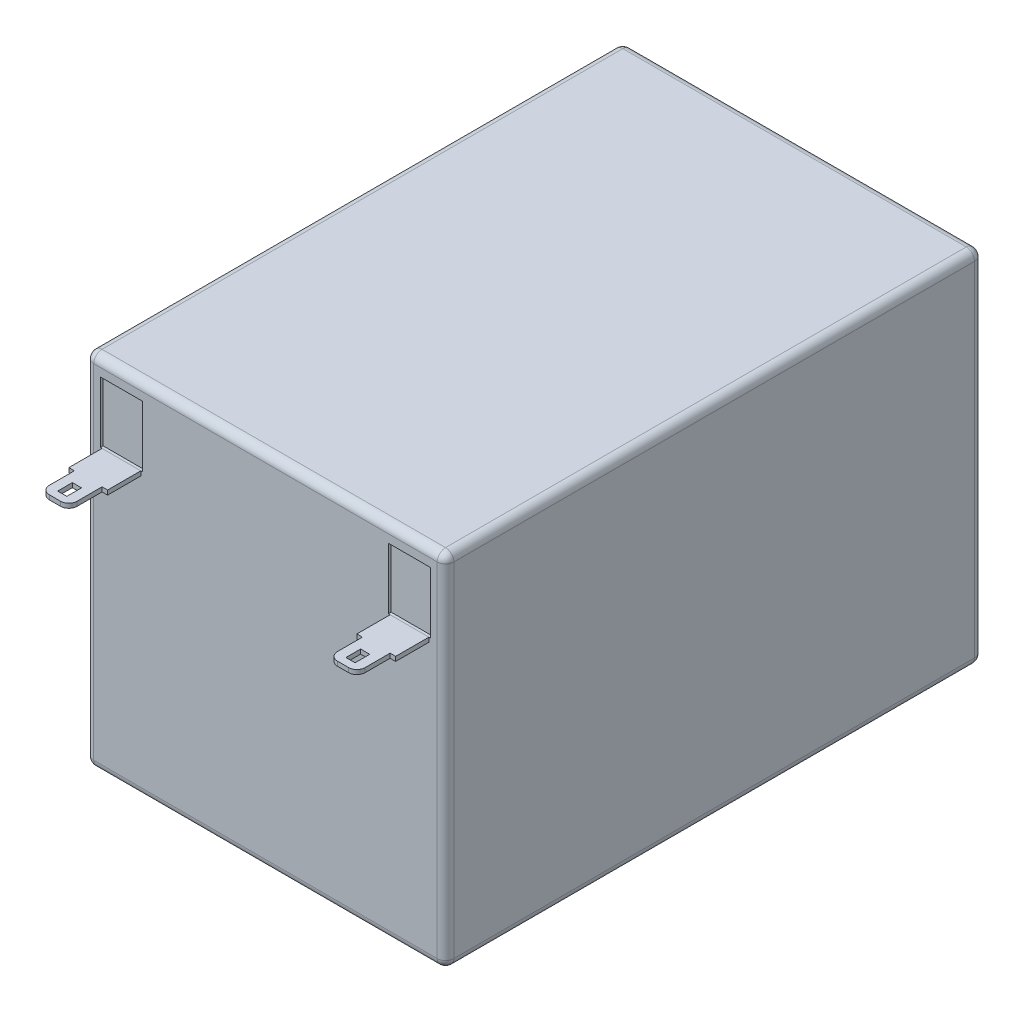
ISO-10303-21;
HEADER;
FILE_DESCRIPTION(('STEP AP214'),'2;1');
FILE_NAME('part.step','',(''),(''),'','','');
FILE_SCHEMA(('AUTOMOTIVE_DESIGN { 1 0 10303 214 1 1 1 1 }'));
ENDSEC;
DATA;
#1=APPLICATION_CONTEXT('core data for automotive mechanical design processes');
#2=APPLICATION_PROTOCOL_DEFINITION('international standard','automotive_design',2000,#1);
#3=PRODUCT_CONTEXT('',#1,'mechanical');
#4=PRODUCT('Part','Part','',(#3));
#5=PRODUCT_RELATED_PRODUCT_CATEGORY('part','',(#4));
#6=PRODUCT_DEFINITION_FORMATION('','',#4);
#7=PRODUCT_DEFINITION_CONTEXT('part definition',#1,'design');
#8=PRODUCT_DEFINITION('design','',#6,#7);
#9=PRODUCT_DEFINITION_SHAPE('','',#8);
#10=(LENGTH_UNIT() NAMED_UNIT(*) SI_UNIT(.MILLI.,.METRE.));
#11=(NAMED_UNIT(*) PLANE_ANGLE_UNIT() SI_UNIT($,.RADIAN.));
#12=(NAMED_UNIT(*) SI_UNIT($,.STERADIAN.) SOLID_ANGLE_UNIT());
#13=UNCERTAINTY_MEASURE_WITH_UNIT(LENGTH_MEASURE(1.E-05),#10,'distance_accuracy_value','');
#14=(GEOMETRIC_REPRESENTATION_CONTEXT(3) GLOBAL_UNCERTAINTY_ASSIGNED_CONTEXT((#13)) GLOBAL_UNIT_ASSIGNED_CONTEXT((#10,
#11,#12)) REPRESENTATION_CONTEXT('',''));
#15=CARTESIAN_POINT('',(0.,0.,0.));
#16=DIRECTION('',(0.,0.,1.));
#17=DIRECTION('',(1.,0.,0.));
#18=AXIS2_PLACEMENT_3D('',#15,#16,#17);
#19=CARTESIAN_POINT('',(-22.4005818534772,-21.6750569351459,97.));
#20=DIRECTION('',(0.,0.,1.));
#21=DIRECTION('',(1.,0.,0.));
#22=AXIS2_PLACEMENT_3D('',#19,#20,#21);
#23=PLANE('',#22);
#24=DIRECTION('',(1.,0.,0.));
#25=VECTOR('',#24,1.);
#26=CARTESIAN_POINT('',(-12.0789088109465,29.3250450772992,97.));
#27=LINE('',#26,#25);
#28=CARTESIAN_POINT('',(-19.6900715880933,29.3250450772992,97.));
#29=VERTEX_POINT('',#28);
#30=CARTESIAN_POINT('',(-12.0789088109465,29.3250450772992,97.));
#31=VERTEX_POINT('',#30);
#32=EDGE_CURVE('E47',#29,#31,#27,.T.);
#33=ORIENTED_EDGE('',*,*,#32,.F.);
#34=DIRECTION('',(0.,-1.,0.));
#35=VECTOR('',#34,1.);
#36=CARTESIAN_POINT('',(-19.6900715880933,29.3250450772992,97.));
#37=LINE('',#36,#35);
#38=CARTESIAN_POINT('',(-19.6900715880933,40.3572573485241,97.));
#39=VERTEX_POINT('',#38);
#40=EDGE_CURVE('E357',#39,#29,#37,.T.);
#41=ORIENTED_EDGE('',*,*,#40,.F.);
#42=DIRECTION('',(-1.,0.,0.));
#43=VECTOR('',#42,1.);
#44=CARTESIAN_POINT('',(-12.0789088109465,40.3572573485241,97.));
#45=LINE('',#44,#43);
#46=CARTESIAN_POINT('',(-12.0789088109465,40.3572573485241,97.));
#47=VERTEX_POINT('',#46);
#48=EDGE_CURVE('E360',#47,#39,#45,.T.);
#49=ORIENTED_EDGE('',*,*,#48,.F.);
#50=DIRECTION('',(0.,1.,0.));
#51=VECTOR('',#50,1.);
#52=CARTESIAN_POINT('',(-12.0789088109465,29.3250450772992,97.));
#53=LINE('',#52,#51);
#54=EDGE_CURVE('E366',#31,#47,#53,.T.);
#55=ORIENTED_EDGE('',*,*,#54,.F.);
#56=EDGE_LOOP('',(#33,#41,#49,#55));
#57=FACE_BOUND('',#56,.T.);
#58=DIRECTION('',(0.,-1.,0.));
#59=VECTOR('',#58,1.);
#60=CARTESIAN_POINT('',(32.2777451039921,29.3250450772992,97.));
#61=LINE('',#60,#59);
#62=CARTESIAN_POINT('',(32.2777451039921,40.3572573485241,97.));
#63=VERTEX_POINT('',#62);
#64=CARTESIAN_POINT('',(32.2777451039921,29.3250450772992,97.));
#65=VERTEX_POINT('',#64);
#66=EDGE_CURVE('E55',#63,#65,#61,.T.);
#67=ORIENTED_EDGE('',*,*,#66,.F.);
#68=DIRECTION('',(-1.,0.,0.));
#69=VECTOR('',#68,1.);
#70=CARTESIAN_POINT('',(32.2777451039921,40.3572573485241,97.));
#71=LINE('',#70,#69);
#72=CARTESIAN_POINT('',(39.8889078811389,40.3572573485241,97.));
#73=VERTEX_POINT('',#72);
#74=EDGE_CURVE('E379',#73,#63,#71,.T.);
#75=ORIENTED_EDGE('',*,*,#74,.F.);
#76=DIRECTION('',(0.,1.,0.));
#77=VECTOR('',#76,1.);
#78=CARTESIAN_POINT('',(39.8889078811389,29.3250450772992,97.));
#79=LINE('',#78,#77);
#80=CARTESIAN_POINT('',(39.8889078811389,29.3250450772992,97.));
#81=VERTEX_POINT('',#80);
#82=EDGE_CURVE('E393',#81,#73,#79,.T.);
#83=ORIENTED_EDGE('',*,*,#82,.F.);
#84=DIRECTION('',(1.,0.,0.));
#85=VECTOR('',#84,1.);
#86=CARTESIAN_POINT('',(32.2777451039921,29.3250450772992,97.));
#87=LINE('',#86,#85);
#88=EDGE_CURVE('E390',#65,#81,#87,.T.);
#89=ORIENTED_EDGE('',*,*,#88,.F.);
#90=EDGE_LOOP('',(#67,#75,#83,#89));
#91=FACE_BOUND('',#90,.T.);
#92=DIRECTION('',(1.,0.,0.));
#93=VECTOR('',#92,1.);
#94=CARTESIAN_POINT('',(-19.4005818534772,28.5249430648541,97.));
#95=LINE('',#94,#93);
#96=CARTESIAN_POINT('',(-19.4005818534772,28.5249430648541,97.));
#97=VERTEX_POINT('',#96);
#98=CARTESIAN_POINT('',(-12.4005818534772,28.5249430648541,97.));
#99=VERTEX_POINT('',#98);
#100=EDGE_CURVE('E544',#97,#99,#95,.T.);
#101=ORIENTED_EDGE('',*,*,#100,.F.);
#102=DIRECTION('',(0.,-1.,0.));
#103=VECTOR('',#102,1.);
#104=CARTESIAN_POINT('',(-19.4005818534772,29.3249430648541,97.));
#105=LINE('',#104,#103);
#106=CARTESIAN_POINT('',(-19.4005818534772,29.3249430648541,97.));
#107=VERTEX_POINT('',#106);
#108=EDGE_CURVE('E533',#107,#97,#105,.T.);
#109=ORIENTED_EDGE('',*,*,#108,.F.);
#110=DIRECTION('',(-1.,0.,0.));
#111=VECTOR('',#110,1.);
#112=CARTESIAN_POINT('',(-19.4005818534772,29.3249430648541,97.));
#113=LINE('',#112,#111);
#114=CARTESIAN_POINT('',(-12.4005818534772,29.3249430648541,97.));
#115=VERTEX_POINT('',#114);
#116=EDGE_CURVE('E538',#115,#107,#113,.T.);
#117=ORIENTED_EDGE('',*,*,#116,.F.);
#118=DIRECTION('',(0.,1.,0.));
#119=VECTOR('',#118,1.);
#120=CARTESIAN_POINT('',(-12.4005818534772,29.3249430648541,97.));
#121=LINE('',#120,#119);
#122=EDGE_CURVE('E547',#99,#115,#121,.T.);
#123=ORIENTED_EDGE('',*,*,#122,.F.);
#124=EDGE_LOOP('',(#101,#109,#117,#123));
#125=FACE_BOUND('',#124,.T.);
#126=DIRECTION('',(0.,1.,0.));
#127=VECTOR('',#126,1.);
#128=CARTESIAN_POINT('',(41.0994181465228,43.3249430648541,97.));
#129=LINE('',#128,#127);
#130=CARTESIAN_POINT('',(41.0994181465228,-20.1750569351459,97.));
#131=VERTEX_POINT('',#130);
#132=CARTESIAN_POINT('',(41.0994181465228,41.8249430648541,97.));
#133=VERTEX_POINT('',#132);
#134=EDGE_CURVE('E610',#131,#133,#129,.T.);
#135=ORIENTED_EDGE('',*,*,#134,.T.);
#136=DIRECTION('',(-1.,0.,0.));
#137=VECTOR('',#136,1.);
#138=CARTESIAN_POINT('',(-22.4005818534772,41.8249430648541,97.));
#139=LINE('',#138,#137);
#140=CARTESIAN_POINT('',(-20.9005818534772,41.8249430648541,97.));
#141=VERTEX_POINT('',#140);
#142=EDGE_CURVE('E612',#133,#141,#139,.T.);
#143=ORIENTED_EDGE('',*,*,#142,.T.);
#144=DIRECTION('',(0.,-1.,0.));
#145=VECTOR('',#144,1.);
#146=CARTESIAN_POINT('',(-20.9005818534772,-21.6750569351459,97.));
#147=LINE('',#146,#145);
#148=CARTESIAN_POINT('',(-20.9005818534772,-20.1750569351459,97.));
#149=VERTEX_POINT('',#148);
#150=EDGE_CURVE('E606',#141,#149,#147,.T.);
#151=ORIENTED_EDGE('',*,*,#150,.T.);
#152=DIRECTION('',(1.,0.,0.));
#153=VECTOR('',#152,1.);
#154=CARTESIAN_POINT('',(42.5994181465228,-20.1750569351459,97.));
#155=LINE('',#154,#153);
#156=EDGE_CURVE('E608',#149,#131,#155,.T.);
#157=ORIENTED_EDGE('',*,*,#156,.T.);
#158=EDGE_LOOP('',(#135,#143,#151,#157));
#159=FACE_BOUND('',#158,.T.);
#160=DIRECTION('',(0.,-1.,0.));
#161=VECTOR('',#160,1.);
#162=CARTESIAN_POINT('',(32.5994181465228,29.3249430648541,97.));
#163=LINE('',#162,#161);
#164=CARTESIAN_POINT('',(32.5994181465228,29.3249430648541,97.));
#165=VERTEX_POINT('',#164);
#166=CARTESIAN_POINT('',(32.5994181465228,28.5249430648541,97.));
#167=VERTEX_POINT('',#166);
#168=EDGE_CURVE('E518',#165,#167,#163,.T.);
#169=ORIENTED_EDGE('',*,*,#168,.F.);
#170=DIRECTION('',(-1.,0.,0.));
#171=VECTOR('',#170,1.);
#172=CARTESIAN_POINT('',(39.5994181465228,29.3249430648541,97.));
#173=LINE('',#172,#171);
#174=CARTESIAN_POINT('',(39.5994181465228,29.3249430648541,97.));
#175=VERTEX_POINT('',#174);
#176=EDGE_CURVE('E507',#175,#165,#173,.T.);
#177=ORIENTED_EDGE('',*,*,#176,.F.);
#178=DIRECTION('',(0.,1.,0.));
#179=VECTOR('',#178,1.);
#180=CARTESIAN_POINT('',(39.5994181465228,29.3249430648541,97.));
#181=LINE('',#180,#179);
#182=CARTESIAN_POINT('',(39.5994181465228,28.5249430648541,97.));
#183=VERTEX_POINT('',#182);
#184=EDGE_CURVE('E512',#183,#175,#181,.T.);
#185=ORIENTED_EDGE('',*,*,#184,.F.);
#186=DIRECTION('',(1.,0.,0.));
#187=VECTOR('',#186,1.);
#188=CARTESIAN_POINT('',(39.5994181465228,28.5249430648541,97.));
#189=LINE('',#188,#187);
#190=EDGE_CURVE('E521',#167,#183,#189,.T.);
#191=ORIENTED_EDGE('',*,*,#190,.F.);
#192=EDGE_LOOP('',(#169,#177,#185,#191));
#193=FACE_BOUND('',#192,.T.);
#194=ADVANCED_FACE('F32',(#57,#91,#125,#159,#193),#23,.T.);
#195=CARTESIAN_POINT('',(-22.4005818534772,43.3249430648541,97.));
#196=DIRECTION('',(1.,0.,0.));
#197=DIRECTION('',(0.,1.,0.));
#198=AXIS2_PLACEMENT_3D('',#195,#196,#197);
#199=PLANE('',#198);
#200=DIRECTION('',(0.,-1.,0.));
#201=VECTOR('',#200,1.);
#202=CARTESIAN_POINT('',(-22.4005818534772,43.3249430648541,95.5));
#203=LINE('',#202,#201);
#204=CARTESIAN_POINT('',(-22.4005818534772,-20.1750569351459,95.5));
#205=VERTEX_POINT('',#204);
#206=CARTESIAN_POINT('',(-22.4005818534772,41.8249430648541,95.5));
#207=VERTEX_POINT('',#206);
#208=EDGE_CURVE('E599',#205,#207,#203,.F.);
#209=ORIENTED_EDGE('',*,*,#208,.T.);
#210=DIRECTION('',(0.,0.,-1.));
#211=VECTOR('',#210,1.);
#212=CARTESIAN_POINT('',(-22.4005818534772,41.8249430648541,97.));
#213=LINE('',#212,#211);
#214=CARTESIAN_POINT('',(-22.4005818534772,41.8249430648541,1.5));
#215=VERTEX_POINT('',#214);
#216=EDGE_CURVE('E604',#207,#215,#213,.T.);
#217=ORIENTED_EDGE('',*,*,#216,.T.);
#218=DIRECTION('',(0.,-1.,0.));
#219=VECTOR('',#218,1.);
#220=CARTESIAN_POINT('',(-22.4005818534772,43.3249430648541,1.5));
#221=LINE('',#220,#219);
#222=CARTESIAN_POINT('',(-22.4005818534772,-20.1750569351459,1.5));
#223=VERTEX_POINT('',#222);
#224=EDGE_CURVE('E601',#215,#223,#221,.T.);
#225=ORIENTED_EDGE('',*,*,#224,.T.);
#226=DIRECTION('',(0.,0.,-1.));
#227=VECTOR('',#226,1.);
#228=CARTESIAN_POINT('',(-22.4005818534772,-20.1750569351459,97.));
#229=LINE('',#228,#227);
#230=EDGE_CURVE('E597',#223,#205,#229,.F.);
#231=ORIENTED_EDGE('',*,*,#230,.T.);
#232=EDGE_LOOP('',(#209,#217,#225,#231));
#233=FACE_BOUND('',#232,.T.);
#234=ADVANCED_FACE('F800',(#233),#199,.F.);
#235=CARTESIAN_POINT('',(-22.4005818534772,-21.6750569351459,97.));
#236=DIRECTION('',(0.,1.,0.));
#237=DIRECTION('',(0.,0.,1.));
#238=AXIS2_PLACEMENT_3D('',#235,#236,#237);
#239=PLANE('',#238);
#240=DIRECTION('',(1.,0.,0.));
#241=VECTOR('',#240,1.);
#242=CARTESIAN_POINT('',(-22.4005818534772,-21.6750569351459,95.5));
#243=LINE('',#242,#241);
#244=CARTESIAN_POINT('',(41.0994181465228,-21.6750569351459,95.5));
#245=VERTEX_POINT('',#244);
#246=CARTESIAN_POINT('',(-20.9005818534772,-21.6750569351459,95.5));
#247=VERTEX_POINT('',#246);
#248=EDGE_CURVE('E562',#245,#247,#243,.F.);
#249=ORIENTED_EDGE('',*,*,#248,.T.);
#250=DIRECTION('',(0.,0.,-1.));
#251=VECTOR('',#250,1.);
#252=CARTESIAN_POINT('',(-20.9005818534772,-21.6750569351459,97.));
#253=LINE('',#252,#251);
#254=CARTESIAN_POINT('',(-20.9005818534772,-21.6750569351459,1.5));
#255=VERTEX_POINT('',#254);
#256=EDGE_CURVE('E568',#247,#255,#253,.T.);
#257=ORIENTED_EDGE('',*,*,#256,.T.);
#258=DIRECTION('',(1.,0.,0.));
#259=VECTOR('',#258,1.);
#260=CARTESIAN_POINT('',(-22.4005818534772,-21.6750569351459,1.5));
#261=LINE('',#260,#259);
#262=CARTESIAN_POINT('',(41.0994181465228,-21.6750569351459,1.5));
#263=VERTEX_POINT('',#262);
#264=EDGE_CURVE('E565',#255,#263,#261,.T.);
#265=ORIENTED_EDGE('',*,*,#264,.T.);
#266=DIRECTION('',(0.,0.,-1.));
#267=VECTOR('',#266,1.);
#268=CARTESIAN_POINT('',(41.0994181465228,-21.6750569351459,97.));
#269=LINE('',#268,#267);
#270=EDGE_CURVE('E560',#263,#245,#269,.F.);
#271=ORIENTED_EDGE('',*,*,#270,.T.);
#272=EDGE_LOOP('',(#249,#257,#265,#271));
#273=FACE_BOUND('',#272,.T.);
#274=ADVANCED_FACE('F806',(#273),#239,.F.);
#275=CARTESIAN_POINT('',(42.5994181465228,43.3249430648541,97.));
#276=DIRECTION('',(-1.,0.,0.));
#277=DIRECTION('',(0.,-1.,0.));
#278=AXIS2_PLACEMENT_3D('',#275,#276,#277);
#279=PLANE('',#278);
#280=DIRECTION('',(0.,1.,0.));
#281=VECTOR('',#280,1.);
#282=CARTESIAN_POINT('',(42.5994181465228,43.3249430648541,1.5));
#283=LINE('',#282,#281);
#284=CARTESIAN_POINT('',(42.5994181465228,-20.1750569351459,1.5));
#285=VERTEX_POINT('',#284);
#286=CARTESIAN_POINT('',(42.5994181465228,41.8249430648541,1.5));
#287=VERTEX_POINT('',#286);
#288=EDGE_CURVE('E583',#285,#287,#283,.T.);
#289=ORIENTED_EDGE('',*,*,#288,.T.);
#290=DIRECTION('',(0.,0.,-1.));
#291=VECTOR('',#290,1.);
#292=CARTESIAN_POINT('',(42.5994181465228,41.8249430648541,97.));
#293=LINE('',#292,#291);
#294=CARTESIAN_POINT('',(42.5994181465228,41.8249430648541,95.5));
#295=VERTEX_POINT('',#294);
#296=EDGE_CURVE('E586',#287,#295,#293,.F.);
#297=ORIENTED_EDGE('',*,*,#296,.T.);
#298=DIRECTION('',(0.,1.,0.));
#299=VECTOR('',#298,1.);
#300=CARTESIAN_POINT('',(42.5994181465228,-21.6750569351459,95.5));
#301=LINE('',#300,#299);
#302=CARTESIAN_POINT('',(42.5994181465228,-20.1750569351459,95.5));
#303=VERTEX_POINT('',#302);
#304=EDGE_CURVE('E581',#295,#303,#301,.F.);
#305=ORIENTED_EDGE('',*,*,#304,.T.);
#306=DIRECTION('',(0.,0.,-1.));
#307=VECTOR('',#306,1.);
#308=CARTESIAN_POINT('',(42.5994181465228,-20.1750569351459,97.));
#309=LINE('',#308,#307);
#310=EDGE_CURVE('E579',#303,#285,#309,.T.);
#311=ORIENTED_EDGE('',*,*,#310,.T.);
#312=EDGE_LOOP('',(#289,#297,#305,#311));
#313=FACE_BOUND('',#312,.T.);
#314=ADVANCED_FACE('F822',(#313),#279,.F.);
#315=CARTESIAN_POINT('',(-22.4005818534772,43.3249430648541,97.));
#316=DIRECTION('',(0.,-1.,0.));
#317=DIRECTION('',(0.,0.,-1.));
#318=AXIS2_PLACEMENT_3D('',#315,#316,#317);
#319=PLANE('',#318);
#320=DIRECTION('',(-1.,0.,0.));
#321=VECTOR('',#320,1.);
#322=CARTESIAN_POINT('',(-22.4005818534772,43.3249430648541,1.5));
#323=LINE('',#322,#321);
#324=CARTESIAN_POINT('',(41.0994181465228,43.3249430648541,1.5));
#325=VERTEX_POINT('',#324);
#326=CARTESIAN_POINT('',(-20.9005818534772,43.3249430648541,1.5));
#327=VERTEX_POINT('',#326);
#328=EDGE_CURVE('E592',#325,#327,#323,.T.);
#329=ORIENTED_EDGE('',*,*,#328,.T.);
#330=DIRECTION('',(0.,0.,-1.));
#331=VECTOR('',#330,1.);
#332=CARTESIAN_POINT('',(-20.9005818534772,43.3249430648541,97.));
#333=LINE('',#332,#331);
#334=CARTESIAN_POINT('',(-20.9005818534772,43.3249430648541,95.5));
#335=VERTEX_POINT('',#334);
#336=EDGE_CURVE('E595',#327,#335,#333,.F.);
#337=ORIENTED_EDGE('',*,*,#336,.T.);
#338=DIRECTION('',(-1.,0.,0.));
#339=VECTOR('',#338,1.);
#340=CARTESIAN_POINT('',(42.5994181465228,43.3249430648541,95.5));
#341=LINE('',#340,#339);
#342=CARTESIAN_POINT('',(41.0994181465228,43.3249430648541,95.5));
#343=VERTEX_POINT('',#342);
#344=EDGE_CURVE('E590',#335,#343,#341,.F.);
#345=ORIENTED_EDGE('',*,*,#344,.T.);
#346=DIRECTION('',(0.,0.,-1.));
#347=VECTOR('',#346,1.);
#348=CARTESIAN_POINT('',(41.0994181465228,43.3249430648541,97.));
#349=LINE('',#348,#347);
#350=EDGE_CURVE('E588',#343,#325,#349,.T.);
#351=ORIENTED_EDGE('',*,*,#350,.T.);
#352=EDGE_LOOP('',(#329,#337,#345,#351));
#353=FACE_BOUND('',#352,.T.);
#354=ADVANCED_FACE('F818',(#353),#319,.F.);
#355=CARTESIAN_POINT('',(-22.4005818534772,-21.6750569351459,0.));
#356=DIRECTION('',(0.,0.,1.));
#357=DIRECTION('',(1.,0.,0.));
#358=AXIS2_PLACEMENT_3D('',#355,#356,#357);
#359=PLANE('',#358);
#360=DIRECTION('',(0.,1.,0.));
#361=VECTOR('',#360,1.);
#362=CARTESIAN_POINT('',(41.0994181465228,-21.6750569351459,0.));
#363=LINE('',#362,#361);
#364=CARTESIAN_POINT('',(41.0994181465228,41.8249430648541,0.));
#365=VERTEX_POINT('',#364);
#366=CARTESIAN_POINT('',(41.0994181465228,-20.1750569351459,0.));
#367=VERTEX_POINT('',#366);
#368=EDGE_CURVE('E574',#365,#367,#363,.F.);
#369=ORIENTED_EDGE('',*,*,#368,.T.);
#370=DIRECTION('',(1.,0.,0.));
#371=VECTOR('',#370,1.);
#372=CARTESIAN_POINT('',(-22.4005818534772,-20.1750569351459,0.));
#373=LINE('',#372,#371);
#374=CARTESIAN_POINT('',(-20.9005818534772,-20.1750569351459,0.));
#375=VERTEX_POINT('',#374);
#376=EDGE_CURVE('E576',#367,#375,#373,.F.);
#377=ORIENTED_EDGE('',*,*,#376,.T.);
#378=DIRECTION('',(0.,-1.,0.));
#379=VECTOR('',#378,1.);
#380=CARTESIAN_POINT('',(-20.9005818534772,-21.6750569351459,0.));
#381=LINE('',#380,#379);
#382=CARTESIAN_POINT('',(-20.9005818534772,41.8249430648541,0.));
#383=VERTEX_POINT('',#382);
#384=EDGE_CURVE('E570',#375,#383,#381,.F.);
#385=ORIENTED_EDGE('',*,*,#384,.T.);
#386=DIRECTION('',(-1.,0.,0.));
#387=VECTOR('',#386,1.);
#388=CARTESIAN_POINT('',(-22.4005818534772,41.8249430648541,0.));
#389=LINE('',#388,#387);
#390=EDGE_CURVE('E572',#383,#365,#389,.F.);
#391=ORIENTED_EDGE('',*,*,#390,.T.);
#392=EDGE_LOOP('',(#369,#377,#385,#391));
#393=FACE_BOUND('',#392,.T.);
#394=ADVANCED_FACE('F814',(#393),#359,.F.);
#395=CARTESIAN_POINT('',(-22.4005818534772,41.8249430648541,95.5));
#396=DIRECTION('',(1.,0.,0.));
#397=DIRECTION('',(0.,0.,-1.));
#398=AXIS2_PLACEMENT_3D('',#395,#396,#397);
#399=CYLINDRICAL_SURFACE('',#398,1.5);
#400=CARTESIAN_POINT('',(-20.9005818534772,41.8249430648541,95.5));
#401=DIRECTION('',(-1.,0.,0.));
#402=DIRECTION('',(0.,0.,1.));
#403=AXIS2_PLACEMENT_3D('',#400,#401,#402);
#404=CIRCLE('',#403,1.5);
#405=EDGE_CURVE('E563',#141,#335,#404,.T.);
#406=ORIENTED_EDGE('',*,*,#405,.F.);
#407=ORIENTED_EDGE('',*,*,#142,.F.);
#408=CARTESIAN_POINT('',(41.0994181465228,41.8249430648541,95.5));
#409=DIRECTION('',(1.,0.,0.));
#410=DIRECTION('',(0.,0.,-1.));
#411=AXIS2_PLACEMENT_3D('',#408,#409,#410);
#412=CIRCLE('',#411,1.5);
#413=EDGE_CURVE('E676',#343,#133,#412,.T.);
#414=ORIENTED_EDGE('',*,*,#413,.F.);
#415=ORIENTED_EDGE('',*,*,#344,.F.);
#416=EDGE_LOOP('',(#406,#407,#414,#415));
#417=FACE_BOUND('',#416,.T.);
#418=ADVANCED_FACE('F817',(#417),#399,.T.);
#419=CARTESIAN_POINT('',(-20.9005818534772,41.8249430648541,95.5));
#420=DIRECTION('',(0.,0.,1.));
#421=DIRECTION('',(1.,0.,0.));
#422=AXIS2_PLACEMENT_3D('',#419,#420,#421);
#423=SPHERICAL_SURFACE('',#422,1.5);
#424=CARTESIAN_POINT('',(-20.9005818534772,41.8249430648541,95.5));
#425=DIRECTION('',(0.,1.,0.));
#426=DIRECTION('',(0.,0.,1.));
#427=AXIS2_PLACEMENT_3D('',#424,#425,#426);
#428=CIRCLE('',#427,1.5);
#429=EDGE_CURVE('E670',#141,#207,#428,.F.);
#430=ORIENTED_EDGE('',*,*,#429,.F.);
#431=ORIENTED_EDGE('',*,*,#405,.T.);
#432=CARTESIAN_POINT('',(-20.9005818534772,41.8249430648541,95.5));
#433=DIRECTION('',(0.,0.,1.));
#434=DIRECTION('',(1.,0.,0.));
#435=AXIS2_PLACEMENT_3D('',#432,#433,#434);
#436=CIRCLE('',#435,1.5);
#437=EDGE_CURVE('E673',#207,#335,#436,.F.);
#438=ORIENTED_EDGE('',*,*,#437,.F.);
#439=EDGE_LOOP('',(#430,#431,#438));
#440=FACE_BOUND('',#439,.T.);
#441=ADVANCED_FACE('F901',(#440),#423,.T.);
#442=CARTESIAN_POINT('',(41.0994181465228,41.8249430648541,95.5));
#443=DIRECTION('',(0.,0.,1.));
#444=DIRECTION('',(1.,0.,0.));
#445=AXIS2_PLACEMENT_3D('',#442,#443,#444);
#446=SPHERICAL_SURFACE('',#445,1.5);
#447=CARTESIAN_POINT('',(41.0994181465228,41.8249430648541,95.5));
#448=DIRECTION('',(0.,0.,1.));
#449=DIRECTION('',(1.,0.,0.));
#450=AXIS2_PLACEMENT_3D('',#447,#448,#449);
#451=CIRCLE('',#450,1.5);
#452=EDGE_CURVE('E664',#343,#295,#451,.F.);
#453=ORIENTED_EDGE('',*,*,#452,.F.);
#454=ORIENTED_EDGE('',*,*,#413,.T.);
#455=CARTESIAN_POINT('',(41.0994181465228,41.8249430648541,95.5));
#456=DIRECTION('',(0.,1.,0.));
#457=DIRECTION('',(0.,0.,1.));
#458=AXIS2_PLACEMENT_3D('',#455,#456,#457);
#459=CIRCLE('',#458,1.5);
#460=EDGE_CURVE('E667',#295,#133,#459,.F.);
#461=ORIENTED_EDGE('',*,*,#460,.F.);
#462=EDGE_LOOP('',(#453,#454,#461));
#463=FACE_BOUND('',#462,.T.);
#464=ADVANCED_FACE('F897',(#463),#446,.T.);
#465=CARTESIAN_POINT('',(-20.9005818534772,41.8249430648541,97.));
#466=DIRECTION('',(0.,0.,-1.));
#467=DIRECTION('',(-1.,0.,0.));
#468=AXIS2_PLACEMENT_3D('',#465,#466,#467);
#469=CYLINDRICAL_SURFACE('',#468,1.5);
#470=ORIENTED_EDGE('',*,*,#437,.T.);
#471=ORIENTED_EDGE('',*,*,#336,.F.);
#472=CARTESIAN_POINT('',(-20.9005818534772,41.8249430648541,1.5));
#473=DIRECTION('',(0.,0.,-1.));
#474=DIRECTION('',(-1.,0.,0.));
#475=AXIS2_PLACEMENT_3D('',#472,#473,#474);
#476=CIRCLE('',#475,1.5);
#477=EDGE_CURVE('E659',#215,#327,#476,.T.);
#478=ORIENTED_EDGE('',*,*,#477,.F.);
#479=ORIENTED_EDGE('',*,*,#216,.F.);
#480=EDGE_LOOP('',(#470,#471,#478,#479));
#481=FACE_BOUND('',#480,.T.);
#482=ADVANCED_FACE('F893',(#481),#469,.T.);
#483=CARTESIAN_POINT('',(-20.9005818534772,-21.6750569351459,95.5));
#484=DIRECTION('',(0.,1.,0.));
#485=DIRECTION('',(-1.,0.,0.));
#486=AXIS2_PLACEMENT_3D('',#483,#484,#485);
#487=CYLINDRICAL_SURFACE('',#486,1.5);
#488=ORIENTED_EDGE('',*,*,#429,.T.);
#489=ORIENTED_EDGE('',*,*,#208,.F.);
#490=CARTESIAN_POINT('',(-20.9005818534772,-20.1750569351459,95.5));
#491=DIRECTION('',(0.,-1.,0.));
#492=DIRECTION('',(0.,0.,-1.));
#493=AXIS2_PLACEMENT_3D('',#490,#491,#492);
#494=CIRCLE('',#493,1.5);
#495=EDGE_CURVE('E656',#149,#205,#494,.T.);
#496=ORIENTED_EDGE('',*,*,#495,.F.);
#497=ORIENTED_EDGE('',*,*,#150,.F.);
#498=EDGE_LOOP('',(#488,#489,#496,#497));
#499=FACE_BOUND('',#498,.T.);
#500=ADVANCED_FACE('F889',(#499),#487,.T.);
#501=CARTESIAN_POINT('',(-22.4005818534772,-20.1750569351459,95.5));
#502=DIRECTION('',(-1.,0.,0.));
#503=DIRECTION('',(0.,0.,1.));
#504=AXIS2_PLACEMENT_3D('',#501,#502,#503);
#505=CYLINDRICAL_SURFACE('',#504,1.5);
#506=CARTESIAN_POINT('',(41.0994181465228,-20.1750569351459,95.5));
#507=DIRECTION('',(1.,0.,0.));
#508=DIRECTION('',(0.,0.,-1.));
#509=AXIS2_PLACEMENT_3D('',#506,#507,#508);
#510=CIRCLE('',#509,1.5);
#511=EDGE_CURVE('E650',#131,#245,#510,.T.);
#512=ORIENTED_EDGE('',*,*,#511,.F.);
#513=ORIENTED_EDGE('',*,*,#156,.F.);
#514=CARTESIAN_POINT('',(-20.9005818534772,-20.1750569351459,95.5));
#515=DIRECTION('',(-1.,0.,0.));
#516=DIRECTION('',(0.,0.,1.));
#517=AXIS2_PLACEMENT_3D('',#514,#515,#516);
#518=CIRCLE('',#517,1.5);
#519=EDGE_CURVE('E653',#247,#149,#518,.T.);
#520=ORIENTED_EDGE('',*,*,#519,.F.);
#521=ORIENTED_EDGE('',*,*,#248,.F.);
#522=EDGE_LOOP('',(#512,#513,#520,#521));
#523=FACE_BOUND('',#522,.T.);
#524=ADVANCED_FACE('F885',(#523),#505,.T.);
#525=CARTESIAN_POINT('',(41.0994181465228,-21.6750569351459,95.5));
#526=DIRECTION('',(0.,-1.,0.));
#527=DIRECTION('',(1.,0.,0.));
#528=AXIS2_PLACEMENT_3D('',#525,#526,#527);
#529=CYLINDRICAL_SURFACE('',#528,1.5);
#530=ORIENTED_EDGE('',*,*,#460,.T.);
#531=ORIENTED_EDGE('',*,*,#134,.F.);
#532=CARTESIAN_POINT('',(41.0994181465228,-20.1750569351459,95.5));
#533=DIRECTION('',(0.,-1.,0.));
#534=DIRECTION('',(0.,0.,-1.));
#535=AXIS2_PLACEMENT_3D('',#532,#533,#534);
#536=CIRCLE('',#535,1.5);
#537=EDGE_CURVE('E647',#303,#131,#536,.T.);
#538=ORIENTED_EDGE('',*,*,#537,.F.);
#539=ORIENTED_EDGE('',*,*,#304,.F.);
#540=EDGE_LOOP('',(#530,#531,#538,#539));
#541=FACE_BOUND('',#540,.T.);
#542=ADVANCED_FACE('F881',(#541),#529,.T.);
#543=CARTESIAN_POINT('',(41.0994181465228,41.8249430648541,97.));
#544=DIRECTION('',(0.,0.,-1.));
#545=DIRECTION('',(-1.,0.,0.));
#546=AXIS2_PLACEMENT_3D('',#543,#544,#545);
#547=CYLINDRICAL_SURFACE('',#546,1.5);
#548=ORIENTED_EDGE('',*,*,#452,.T.);
#549=ORIENTED_EDGE('',*,*,#296,.F.);
#550=CARTESIAN_POINT('',(41.0994181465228,41.8249430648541,1.5));
#551=DIRECTION('',(0.,0.,-1.));
#552=DIRECTION('',(-1.,0.,0.));
#553=AXIS2_PLACEMENT_3D('',#550,#551,#552);
#554=CIRCLE('',#553,1.5);
#555=EDGE_CURVE('E644',#325,#287,#554,.T.);
#556=ORIENTED_EDGE('',*,*,#555,.F.);
#557=ORIENTED_EDGE('',*,*,#350,.F.);
#558=EDGE_LOOP('',(#548,#549,#556,#557));
#559=FACE_BOUND('',#558,.T.);
#560=ADVANCED_FACE('F877',(#559),#547,.T.);
#561=CARTESIAN_POINT('',(-22.4005818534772,41.8249430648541,1.5));
#562=DIRECTION('',(-1.,0.,0.));
#563=DIRECTION('',(0.,0.,1.));
#564=AXIS2_PLACEMENT_3D('',#561,#562,#563);
#565=CYLINDRICAL_SURFACE('',#564,1.5);
#566=CARTESIAN_POINT('',(-20.9005818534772,41.8249430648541,1.5));
#567=DIRECTION('',(-1.,0.,0.));
#568=DIRECTION('',(0.,0.,1.));
#569=AXIS2_PLACEMENT_3D('',#566,#567,#568);
#570=CIRCLE('',#569,1.5);
#571=EDGE_CURVE('E661',#327,#383,#570,.T.);
#572=ORIENTED_EDGE('',*,*,#571,.F.);
#573=ORIENTED_EDGE('',*,*,#328,.F.);
#574=CARTESIAN_POINT('',(41.0994181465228,41.8249430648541,1.5));
#575=DIRECTION('',(1.,0.,0.));
#576=DIRECTION('',(0.,1.,0.));
#577=AXIS2_PLACEMENT_3D('',#574,#575,#576);
#578=CIRCLE('',#577,1.5);
#579=EDGE_CURVE('E641',#365,#325,#578,.T.);
#580=ORIENTED_EDGE('',*,*,#579,.F.);
#581=ORIENTED_EDGE('',*,*,#390,.F.);
#582=EDGE_LOOP('',(#572,#573,#580,#581));
#583=FACE_BOUND('',#582,.T.);
#584=ADVANCED_FACE('F873',(#583),#565,.T.);
#585=CARTESIAN_POINT('',(-20.9005818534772,41.8249430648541,1.5));
#586=DIRECTION('',(0.,0.,1.));
#587=DIRECTION('',(1.,0.,0.));
#588=AXIS2_PLACEMENT_3D('',#585,#586,#587);
#589=SPHERICAL_SURFACE('',#588,1.5);
#590=ORIENTED_EDGE('',*,*,#477,.T.);
#591=ORIENTED_EDGE('',*,*,#571,.T.);
#592=CARTESIAN_POINT('',(-20.9005818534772,41.8249430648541,1.5));
#593=DIRECTION('',(0.,1.,0.));
#594=DIRECTION('',(0.,0.,1.));
#595=AXIS2_PLACEMENT_3D('',#592,#593,#594);
#596=CIRCLE('',#595,1.5);
#597=EDGE_CURVE('E638',#215,#383,#596,.F.);
#598=ORIENTED_EDGE('',*,*,#597,.F.);
#599=EDGE_LOOP('',(#590,#591,#598));
#600=FACE_BOUND('',#599,.T.);
#601=ADVANCED_FACE('F869',(#600),#589,.T.);
#602=CARTESIAN_POINT('',(-20.9005818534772,-20.1750569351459,95.5));
#603=DIRECTION('',(0.,0.,1.));
#604=DIRECTION('',(1.,0.,0.));
#605=AXIS2_PLACEMENT_3D('',#602,#603,#604);
#606=SPHERICAL_SURFACE('',#605,1.5);
#607=ORIENTED_EDGE('',*,*,#519,.T.);
#608=ORIENTED_EDGE('',*,*,#495,.T.);
#609=CARTESIAN_POINT('',(-20.9005818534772,-20.1750569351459,95.5));
#610=DIRECTION('',(0.,0.,1.));
#611=DIRECTION('',(1.,0.,0.));
#612=AXIS2_PLACEMENT_3D('',#609,#610,#611);
#613=CIRCLE('',#612,1.5);
#614=EDGE_CURVE('E635',#247,#205,#613,.F.);
#615=ORIENTED_EDGE('',*,*,#614,.F.);
#616=EDGE_LOOP('',(#607,#608,#615));
#617=FACE_BOUND('',#616,.T.);
#618=ADVANCED_FACE('F865',(#617),#606,.T.);
#619=CARTESIAN_POINT('',(41.0994181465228,-20.1750569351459,95.5));
#620=DIRECTION('',(0.,0.,1.));
#621=DIRECTION('',(1.,0.,0.));
#622=AXIS2_PLACEMENT_3D('',#619,#620,#621);
#623=SPHERICAL_SURFACE('',#622,1.5);
#624=ORIENTED_EDGE('',*,*,#537,.T.);
#625=ORIENTED_EDGE('',*,*,#511,.T.);
#626=CARTESIAN_POINT('',(41.0994181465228,-20.1750569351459,95.5));
#627=DIRECTION('',(0.,0.,1.));
#628=DIRECTION('',(1.,0.,0.));
#629=AXIS2_PLACEMENT_3D('',#626,#627,#628);
#630=CIRCLE('',#629,1.5);
#631=EDGE_CURVE('E632',#303,#245,#630,.F.);
#632=ORIENTED_EDGE('',*,*,#631,.F.);
#633=EDGE_LOOP('',(#624,#625,#632));
#634=FACE_BOUND('',#633,.T.);
#635=ADVANCED_FACE('F861',(#634),#623,.T.);
#636=CARTESIAN_POINT('',(41.0994181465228,41.8249430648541,1.5));
#637=DIRECTION('',(0.,0.,1.));
#638=DIRECTION('',(1.,0.,0.));
#639=AXIS2_PLACEMENT_3D('',#636,#637,#638);
#640=SPHERICAL_SURFACE('',#639,1.5);
#641=ORIENTED_EDGE('',*,*,#579,.T.);
#642=ORIENTED_EDGE('',*,*,#555,.T.);
#643=CARTESIAN_POINT('',(41.0994181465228,41.8249430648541,1.5));
#644=DIRECTION('',(0.,1.,0.));
#645=DIRECTION('',(0.,0.,1.));
#646=AXIS2_PLACEMENT_3D('',#643,#644,#645);
#647=CIRCLE('',#646,1.5);
#648=EDGE_CURVE('E630',#365,#287,#647,.F.);
#649=ORIENTED_EDGE('',*,*,#648,.F.);
#650=EDGE_LOOP('',(#641,#642,#649));
#651=FACE_BOUND('',#650,.T.);
#652=ADVANCED_FACE('F857',(#651),#640,.T.);
#653=CARTESIAN_POINT('',(-20.9005818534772,43.3249430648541,1.5));
#654=DIRECTION('',(0.,-1.,0.));
#655=DIRECTION('',(1.,0.,0.));
#656=AXIS2_PLACEMENT_3D('',#653,#654,#655);
#657=CYLINDRICAL_SURFACE('',#656,1.5);
#658=ORIENTED_EDGE('',*,*,#597,.T.);
#659=ORIENTED_EDGE('',*,*,#384,.F.);
#660=CARTESIAN_POINT('',(-20.9005818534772,-20.1750569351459,1.5));
#661=DIRECTION('',(0.,-1.,0.));
#662=DIRECTION('',(0.,0.,-1.));
#663=AXIS2_PLACEMENT_3D('',#660,#661,#662);
#664=CIRCLE('',#663,1.5);
#665=EDGE_CURVE('E627',#223,#375,#664,.T.);
#666=ORIENTED_EDGE('',*,*,#665,.F.);
#667=ORIENTED_EDGE('',*,*,#224,.F.);
#668=EDGE_LOOP('',(#658,#659,#666,#667));
#669=FACE_BOUND('',#668,.T.);
#670=ADVANCED_FACE('F853',(#669),#657,.T.);
#671=CARTESIAN_POINT('',(-20.9005818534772,-20.1750569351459,97.));
#672=DIRECTION('',(0.,0.,-1.));
#673=DIRECTION('',(-1.,0.,0.));
#674=AXIS2_PLACEMENT_3D('',#671,#672,#673);
#675=CYLINDRICAL_SURFACE('',#674,1.5);
#676=ORIENTED_EDGE('',*,*,#614,.T.);
#677=ORIENTED_EDGE('',*,*,#230,.F.);
#678=CARTESIAN_POINT('',(-20.9005818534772,-20.1750569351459,1.5));
#679=DIRECTION('',(0.,0.,-1.));
#680=DIRECTION('',(-1.,0.,0.));
#681=AXIS2_PLACEMENT_3D('',#678,#679,#680);
#682=CIRCLE('',#681,1.5);
#683=EDGE_CURVE('E625',#255,#223,#682,.T.);
#684=ORIENTED_EDGE('',*,*,#683,.F.);
#685=ORIENTED_EDGE('',*,*,#256,.F.);
#686=EDGE_LOOP('',(#676,#677,#684,#685));
#687=FACE_BOUND('',#686,.T.);
#688=ADVANCED_FACE('F849',(#687),#675,.T.);
#689=CARTESIAN_POINT('',(41.0994181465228,-20.1750569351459,97.));
#690=DIRECTION('',(0.,0.,-1.));
#691=DIRECTION('',(-1.,0.,0.));
#692=AXIS2_PLACEMENT_3D('',#689,#690,#691);
#693=CYLINDRICAL_SURFACE('',#692,1.5);
#694=ORIENTED_EDGE('',*,*,#631,.T.);
#695=ORIENTED_EDGE('',*,*,#270,.F.);
#696=CARTESIAN_POINT('',(41.0994181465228,-20.1750569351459,1.5));
#697=DIRECTION('',(0.,0.,-1.));
#698=DIRECTION('',(-1.,0.,0.));
#699=AXIS2_PLACEMENT_3D('',#696,#697,#698);
#700=CIRCLE('',#699,1.5);
#701=EDGE_CURVE('E622',#285,#263,#700,.T.);
#702=ORIENTED_EDGE('',*,*,#701,.F.);
#703=ORIENTED_EDGE('',*,*,#310,.F.);
#704=EDGE_LOOP('',(#694,#695,#702,#703));
#705=FACE_BOUND('',#704,.T.);
#706=ADVANCED_FACE('F845',(#705),#693,.T.);
#707=CARTESIAN_POINT('',(41.0994181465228,43.3249430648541,1.5));
#708=DIRECTION('',(0.,1.,0.));
#709=DIRECTION('',(-1.,0.,0.));
#710=AXIS2_PLACEMENT_3D('',#707,#708,#709);
#711=CYLINDRICAL_SURFACE('',#710,1.5);
#712=ORIENTED_EDGE('',*,*,#648,.T.);
#713=ORIENTED_EDGE('',*,*,#288,.F.);
#714=CARTESIAN_POINT('',(41.0994181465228,-20.1750569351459,1.5));
#715=DIRECTION('',(0.,-1.,0.));
#716=DIRECTION('',(1.,0.,0.));
#717=AXIS2_PLACEMENT_3D('',#714,#715,#716);
#718=CIRCLE('',#717,1.5);
#719=EDGE_CURVE('E619',#367,#285,#718,.T.);
#720=ORIENTED_EDGE('',*,*,#719,.F.);
#721=ORIENTED_EDGE('',*,*,#368,.F.);
#722=EDGE_LOOP('',(#712,#713,#720,#721));
#723=FACE_BOUND('',#722,.T.);
#724=ADVANCED_FACE('F841',(#723),#711,.T.);
#725=CARTESIAN_POINT('',(-20.9005818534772,-20.1750569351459,1.5));
#726=DIRECTION('',(0.,0.,1.));
#727=DIRECTION('',(1.,0.,0.));
#728=AXIS2_PLACEMENT_3D('',#725,#726,#727);
#729=SPHERICAL_SURFACE('',#728,1.5);
#730=ORIENTED_EDGE('',*,*,#683,.T.);
#731=ORIENTED_EDGE('',*,*,#665,.T.);
#732=CARTESIAN_POINT('',(-20.9005818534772,-20.1750569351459,1.5));
#733=DIRECTION('',(-1.,0.,0.));
#734=DIRECTION('',(0.,0.,1.));
#735=AXIS2_PLACEMENT_3D('',#732,#733,#734);
#736=CIRCLE('',#735,1.5);
#737=EDGE_CURVE('E617',#255,#375,#736,.F.);
#738=ORIENTED_EDGE('',*,*,#737,.F.);
#739=EDGE_LOOP('',(#730,#731,#738));
#740=FACE_BOUND('',#739,.T.);
#741=ADVANCED_FACE('F837',(#740),#729,.T.);
#742=CARTESIAN_POINT('',(41.0994181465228,-20.1750569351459,1.5));
#743=DIRECTION('',(0.,0.,1.));
#744=DIRECTION('',(1.,0.,0.));
#745=AXIS2_PLACEMENT_3D('',#742,#743,#744);
#746=SPHERICAL_SURFACE('',#745,1.5);
#747=ORIENTED_EDGE('',*,*,#719,.T.);
#748=ORIENTED_EDGE('',*,*,#701,.T.);
#749=CARTESIAN_POINT('',(41.0994181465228,-20.1750569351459,1.5));
#750=DIRECTION('',(1.,0.,0.));
#751=DIRECTION('',(0.,0.,-1.));
#752=AXIS2_PLACEMENT_3D('',#749,#750,#751);
#753=CIRCLE('',#752,1.5);
#754=EDGE_CURVE('E559',#367,#263,#753,.F.);
#755=ORIENTED_EDGE('',*,*,#754,.F.);
#756=EDGE_LOOP('',(#747,#748,#755));
#757=FACE_BOUND('',#756,.T.);
#758=ADVANCED_FACE('F833',(#757),#746,.T.);
#759=CARTESIAN_POINT('',(-22.4005818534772,-20.1750569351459,1.5));
#760=DIRECTION('',(1.,0.,0.));
#761=DIRECTION('',(0.,0.,-1.));
#762=AXIS2_PLACEMENT_3D('',#759,#760,#761);
#763=CYLINDRICAL_SURFACE('',#762,1.5);
#764=ORIENTED_EDGE('',*,*,#737,.T.);
#765=ORIENTED_EDGE('',*,*,#376,.F.);
#766=ORIENTED_EDGE('',*,*,#754,.T.);
#767=ORIENTED_EDGE('',*,*,#264,.F.);
#768=EDGE_LOOP('',(#764,#765,#766,#767));
#769=FACE_BOUND('',#768,.T.);
#770=ADVANCED_FACE('F830',(#769),#763,.T.);
#771=CARTESIAN_POINT('',(-19.4005818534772,29.3249430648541,109.));
#772=DIRECTION('',(1.,0.,0.));
#773=DIRECTION('',(0.,0.,-1.));
#774=AXIS2_PLACEMENT_3D('',#771,#772,#773);
#775=PLANE('',#774);
#776=DIRECTION('',(0.,0.,-1.));
#777=VECTOR('',#776,1.);
#778=CARTESIAN_POINT('',(-19.4005818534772,28.5249430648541,109.));
#779=LINE('',#778,#777);
#780=CARTESIAN_POINT('',(-19.4005818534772,28.5249430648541,103.));
#781=VERTEX_POINT('',#780);
#782=EDGE_CURVE('E557',#781,#97,#779,.T.);
#783=ORIENTED_EDGE('',*,*,#782,.F.);
#784=DIRECTION('',(0.,1.,0.));
#785=VECTOR('',#784,1.);
#786=CARTESIAN_POINT('',(-19.4005818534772,29.3249430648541,103.));
#787=LINE('',#786,#785);
#788=CARTESIAN_POINT('',(-19.4005818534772,29.3249430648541,103.));
#789=VERTEX_POINT('',#788);
#790=EDGE_CURVE('E501',#781,#789,#787,.T.);
#791=ORIENTED_EDGE('',*,*,#790,.T.);
#792=DIRECTION('',(0.,0.,-1.));
#793=VECTOR('',#792,1.);
#794=CARTESIAN_POINT('',(-19.4005818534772,29.3249430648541,109.));
#795=LINE('',#794,#793);
#796=EDGE_CURVE('E541',#789,#107,#795,.T.);
#797=ORIENTED_EDGE('',*,*,#796,.T.);
#798=ORIENTED_EDGE('',*,*,#108,.T.);
#799=EDGE_LOOP('',(#783,#791,#797,#798));
#800=FACE_BOUND('',#799,.T.);
#801=ADVANCED_FACE('F812',(#800),#775,.F.);
#802=CARTESIAN_POINT('',(-19.4005818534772,28.5249430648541,109.));
#803=DIRECTION('',(0.,1.,0.));
#804=DIRECTION('',(0.,0.,1.));
#805=AXIS2_PLACEMENT_3D('',#802,#803,#804);
#806=PLANE('',#805);
#807=DIRECTION('',(0.,0.,1.));
#808=VECTOR('',#807,1.);
#809=CARTESIAN_POINT('',(-16.7422666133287,28.5249430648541,109.));
#810=LINE('',#809,#808);
#811=CARTESIAN_POINT('',(-16.7422666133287,28.5249430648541,105.017094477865));
#812=VERTEX_POINT('',#811);
#813=CARTESIAN_POINT('',(-16.7422666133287,28.5249430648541,107.672066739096));
#814=VERTEX_POINT('',#813);
#815=EDGE_CURVE('E422',#812,#814,#810,.T.);
#816=ORIENTED_EDGE('',*,*,#815,.T.);
#817=DIRECTION('',(1.,0.,0.));
#818=VECTOR('',#817,1.);
#819=CARTESIAN_POINT('',(-19.4005818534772,28.5249430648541,107.672066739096));
#820=LINE('',#819,#818);
#821=CARTESIAN_POINT('',(-15.091003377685,28.5249430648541,107.672066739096));
#822=VERTEX_POINT('',#821);
#823=EDGE_CURVE('E425',#814,#822,#820,.T.);
#824=ORIENTED_EDGE('',*,*,#823,.T.);
#825=DIRECTION('',(0.,0.,-1.));
#826=VECTOR('',#825,1.);
#827=CARTESIAN_POINT('',(-15.091003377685,28.5249430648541,109.));
#828=LINE('',#827,#826);
#829=CARTESIAN_POINT('',(-15.091003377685,28.5249430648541,105.017094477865));
#830=VERTEX_POINT('',#829);
#831=EDGE_CURVE('E409',#822,#830,#828,.T.);
#832=ORIENTED_EDGE('',*,*,#831,.T.);
#833=DIRECTION('',(-1.,0.,0.));
#834=VECTOR('',#833,1.);
#835=CARTESIAN_POINT('',(-19.4005818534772,28.5249430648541,105.017094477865));
#836=LINE('',#835,#834);
#837=EDGE_CURVE('E419',#830,#812,#836,.T.);
#838=ORIENTED_EDGE('',*,*,#837,.T.);
#839=EDGE_LOOP('',(#816,#824,#832,#838));
#840=FACE_BOUND('',#839,.T.);
#841=DIRECTION('',(1.,0.,0.));
#842=VECTOR('',#841,1.);
#843=CARTESIAN_POINT('',(-19.4005818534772,28.5249430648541,109.));
#844=LINE('',#843,#842);
#845=CARTESIAN_POINT('',(-16.9005818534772,28.5249430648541,109.));
#846=VERTEX_POINT('',#845);
#847=CARTESIAN_POINT('',(-14.9005818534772,28.5249430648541,109.));
#848=VERTEX_POINT('',#847);
#849=EDGE_CURVE('E534',#846,#848,#844,.T.);
#850=ORIENTED_EDGE('',*,*,#849,.F.);
#851=CARTESIAN_POINT('',(-16.9005818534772,28.5249430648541,107.5));
#852=DIRECTION('',(0.,1.,0.));
#853=DIRECTION('',(0.,0.,1.));
#854=AXIS2_PLACEMENT_3D('',#851,#852,#853);
#855=CIRCLE('',#854,1.5);
#856=CARTESIAN_POINT('',(-18.4005818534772,28.5249430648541,107.5));
#857=VERTEX_POINT('',#856);
#858=EDGE_CURVE('E729',#846,#857,#855,.F.);
#859=ORIENTED_EDGE('',*,*,#858,.T.);
#860=DIRECTION('',(0.,0.,-1.));
#861=VECTOR('',#860,1.);
#862=CARTESIAN_POINT('',(-18.4005818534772,28.5249430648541,109.));
#863=LINE('',#862,#861);
#864=CARTESIAN_POINT('',(-18.4005818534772,28.5249430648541,103.));
#865=VERTEX_POINT('',#864);
#866=EDGE_CURVE('E493',#857,#865,#863,.T.);
#867=ORIENTED_EDGE('',*,*,#866,.T.);
#868=DIRECTION('',(-1.,0.,0.));
#869=VECTOR('',#868,1.);
#870=CARTESIAN_POINT('',(-19.4005818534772,28.5249430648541,103.));
#871=LINE('',#870,#869);
#872=EDGE_CURVE('E504',#865,#781,#871,.T.);
#873=ORIENTED_EDGE('',*,*,#872,.T.);
#874=ORIENTED_EDGE('',*,*,#782,.T.);
#875=ORIENTED_EDGE('',*,*,#100,.T.);
#876=DIRECTION('',(0.,0.,-1.));
#877=VECTOR('',#876,1.);
#878=CARTESIAN_POINT('',(-12.4005818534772,28.5249430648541,109.));
#879=LINE('',#878,#877);
#880=CARTESIAN_POINT('',(-12.4005818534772,28.5249430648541,103.));
#881=VERTEX_POINT('',#880);
#882=EDGE_CURVE('E555',#881,#99,#879,.T.);
#883=ORIENTED_EDGE('',*,*,#882,.F.);
#884=DIRECTION('',(-1.,0.,0.));
#885=VECTOR('',#884,1.);
#886=CARTESIAN_POINT('',(-19.4005818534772,28.5249430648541,103.));
#887=LINE('',#886,#885);
#888=CARTESIAN_POINT('',(-13.4005818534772,28.5249430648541,103.));
#889=VERTEX_POINT('',#888);
#890=EDGE_CURVE('E498',#881,#889,#887,.T.);
#891=ORIENTED_EDGE('',*,*,#890,.T.);
#892=DIRECTION('',(0.,0.,1.));
#893=VECTOR('',#892,1.);
#894=CARTESIAN_POINT('',(-13.4005818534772,28.5249430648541,109.));
#895=LINE('',#894,#893);
#896=CARTESIAN_POINT('',(-13.4005818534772,28.5249430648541,107.5));
#897=VERTEX_POINT('',#896);
#898=EDGE_CURVE('E487',#889,#897,#895,.T.);
#899=ORIENTED_EDGE('',*,*,#898,.T.);
#900=CARTESIAN_POINT('',(-14.9005818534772,28.5249430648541,107.5));
#901=DIRECTION('',(0.,1.,0.));
#902=DIRECTION('',(0.,0.,1.));
#903=AXIS2_PLACEMENT_3D('',#900,#901,#902);
#904=CIRCLE('',#903,1.5);
#905=EDGE_CURVE('E727',#897,#848,#904,.F.);
#906=ORIENTED_EDGE('',*,*,#905,.T.);
#907=EDGE_LOOP('',(#850,#859,#867,#873,#874,#875,#883,#891,#899,#906));
#908=FACE_BOUND('',#907,.T.);
#909=ADVANCED_FACE('F1008',(#840,#908),#806,.F.);
#910=CARTESIAN_POINT('',(-12.4005818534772,29.3249430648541,109.));
#911=DIRECTION('',(-1.,0.,0.));
#912=DIRECTION('',(0.,0.,1.));
#913=AXIS2_PLACEMENT_3D('',#910,#911,#912);
#914=PLANE('',#913);
#915=DIRECTION('',(0.,0.,-1.));
#916=VECTOR('',#915,1.);
#917=CARTESIAN_POINT('',(-12.4005818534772,29.3249430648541,109.));
#918=LINE('',#917,#916);
#919=CARTESIAN_POINT('',(-12.4005818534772,29.3249430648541,103.));
#920=VERTEX_POINT('',#919);
#921=EDGE_CURVE('E553',#920,#115,#918,.T.);
#922=ORIENTED_EDGE('',*,*,#921,.F.);
#923=DIRECTION('',(0.,-1.,0.));
#924=VECTOR('',#923,1.);
#925=CARTESIAN_POINT('',(-12.4005818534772,29.3249430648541,103.));
#926=LINE('',#925,#924);
#927=EDGE_CURVE('E495',#920,#881,#926,.T.);
#928=ORIENTED_EDGE('',*,*,#927,.T.);
#929=ORIENTED_EDGE('',*,*,#882,.T.);
#930=ORIENTED_EDGE('',*,*,#122,.T.);
#931=EDGE_LOOP('',(#922,#928,#929,#930));
#932=FACE_BOUND('',#931,.T.);
#933=ADVANCED_FACE('F994',(#932),#914,.F.);
#934=CARTESIAN_POINT('',(-19.4005818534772,29.3249430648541,109.));
#935=DIRECTION('',(0.,-1.,0.));
#936=DIRECTION('',(0.,0.,-1.));
#937=AXIS2_PLACEMENT_3D('',#934,#935,#936);
#938=PLANE('',#937);
#939=DIRECTION('',(0.,0.,1.));
#940=VECTOR('',#939,1.);
#941=CARTESIAN_POINT('',(-15.091003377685,29.3249430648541,109.));
#942=LINE('',#941,#940);
#943=CARTESIAN_POINT('',(-15.091003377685,29.3249430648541,105.017094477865));
#944=VERTEX_POINT('',#943);
#945=CARTESIAN_POINT('',(-15.091003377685,29.3249430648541,107.672066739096));
#946=VERTEX_POINT('',#945);
#947=EDGE_CURVE('E704',#944,#946,#942,.T.);
#948=ORIENTED_EDGE('',*,*,#947,.T.);
#949=DIRECTION('',(-1.,0.,0.));
#950=VECTOR('',#949,1.);
#951=CARTESIAN_POINT('',(-19.4005818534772,29.3249430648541,107.672066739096));
#952=LINE('',#951,#950);
#953=CARTESIAN_POINT('',(-16.7422666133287,29.3249430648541,107.672066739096));
#954=VERTEX_POINT('',#953);
#955=EDGE_CURVE('E713',#946,#954,#952,.T.);
#956=ORIENTED_EDGE('',*,*,#955,.T.);
#957=DIRECTION('',(0.,0.,-1.));
#958=VECTOR('',#957,1.);
#959=CARTESIAN_POINT('',(-16.7422666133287,29.3249430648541,109.));
#960=LINE('',#959,#958);
#961=CARTESIAN_POINT('',(-16.7422666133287,29.3249430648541,105.017094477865));
#962=VERTEX_POINT('',#961);
#963=EDGE_CURVE('E710',#954,#962,#960,.T.);
#964=ORIENTED_EDGE('',*,*,#963,.T.);
#965=DIRECTION('',(1.,0.,0.));
#966=VECTOR('',#965,1.);
#967=CARTESIAN_POINT('',(-19.4005818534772,29.3249430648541,105.017094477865));
#968=LINE('',#967,#966);
#969=EDGE_CURVE('E707',#962,#944,#968,.T.);
#970=ORIENTED_EDGE('',*,*,#969,.T.);
#971=EDGE_LOOP('',(#948,#956,#964,#970));
#972=FACE_BOUND('',#971,.T.);
#973=DIRECTION('',(0.,0.,1.));
#974=VECTOR('',#973,1.);
#975=CARTESIAN_POINT('',(-18.4005818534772,29.3249430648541,109.));
#976=LINE('',#975,#974);
#977=CARTESIAN_POINT('',(-18.4005818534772,29.3249430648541,103.));
#978=VERTEX_POINT('',#977);
#979=CARTESIAN_POINT('',(-18.4005818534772,29.3249430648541,107.5));
#980=VERTEX_POINT('',#979);
#981=EDGE_CURVE('E490',#978,#980,#976,.T.);
#982=ORIENTED_EDGE('',*,*,#981,.T.);
#983=CARTESIAN_POINT('',(-16.9005818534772,29.3249430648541,107.5));
#984=DIRECTION('',(0.,-1.,0.));
#985=DIRECTION('',(0.,0.,-1.));
#986=AXIS2_PLACEMENT_3D('',#983,#984,#985);
#987=CIRCLE('',#986,1.5);
#988=CARTESIAN_POINT('',(-16.9005818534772,29.3249430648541,109.));
#989=VERTEX_POINT('',#988);
#990=EDGE_CURVE('E721',#980,#989,#987,.F.);
#991=ORIENTED_EDGE('',*,*,#990,.T.);
#992=DIRECTION('',(-1.,0.,0.));
#993=VECTOR('',#992,1.);
#994=CARTESIAN_POINT('',(-19.4005818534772,29.3249430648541,109.));
#995=LINE('',#994,#993);
#996=CARTESIAN_POINT('',(-14.9005818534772,29.3249430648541,109.));
#997=VERTEX_POINT('',#996);
#998=EDGE_CURVE('E537',#997,#989,#995,.T.);
#999=ORIENTED_EDGE('',*,*,#998,.F.);
#1000=CARTESIAN_POINT('',(-14.9005818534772,29.3249430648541,107.5));
#1001=DIRECTION('',(0.,-1.,0.));
#1002=DIRECTION('',(0.,0.,-1.));
#1003=AXIS2_PLACEMENT_3D('',#1000,#1001,#1002);
#1004=CIRCLE('',#1003,1.5);
#1005=CARTESIAN_POINT('',(-13.4005818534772,29.3249430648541,107.5));
#1006=VERTEX_POINT('',#1005);
#1007=EDGE_CURVE('E719',#997,#1006,#1004,.F.);
#1008=ORIENTED_EDGE('',*,*,#1007,.T.);
#1009=DIRECTION('',(0.,0.,-1.));
#1010=VECTOR('',#1009,1.);
#1011=CARTESIAN_POINT('',(-13.4005818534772,29.3249430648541,109.));
#1012=LINE('',#1011,#1010);
#1013=CARTESIAN_POINT('',(-13.4005818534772,29.3249430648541,103.));
#1014=VERTEX_POINT('',#1013);
#1015=EDGE_CURVE('E485',#1006,#1014,#1012,.T.);
#1016=ORIENTED_EDGE('',*,*,#1015,.T.);
#1017=DIRECTION('',(1.,0.,0.));
#1018=VECTOR('',#1017,1.);
#1019=CARTESIAN_POINT('',(-19.4005818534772,29.3249430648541,103.));
#1020=LINE('',#1019,#1018);
#1021=EDGE_CURVE('E686',#1014,#920,#1020,.T.);
#1022=ORIENTED_EDGE('',*,*,#1021,.T.);
#1023=ORIENTED_EDGE('',*,*,#921,.T.);
#1024=ORIENTED_EDGE('',*,*,#116,.T.);
#1025=ORIENTED_EDGE('',*,*,#796,.F.);
#1026=DIRECTION('',(1.,0.,0.));
#1027=VECTOR('',#1026,1.);
#1028=CARTESIAN_POINT('',(-19.4005818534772,29.3249430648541,103.));
#1029=LINE('',#1028,#1027);
#1030=EDGE_CURVE('E689',#789,#978,#1029,.T.);
#1031=ORIENTED_EDGE('',*,*,#1030,.T.);
#1032=EDGE_LOOP('',(#982,#991,#999,#1008,#1016,#1022,#1023,#1024,#1025,#1031));
#1033=FACE_BOUND('',#1032,.T.);
#1034=ADVANCED_FACE('F992',(#972,#1033),#938,.F.);
#1035=CARTESIAN_POINT('',(-19.4005818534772,28.5249430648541,109.));
#1036=DIRECTION('',(0.,0.,1.));
#1037=DIRECTION('',(1.,0.,0.));
#1038=AXIS2_PLACEMENT_3D('',#1035,#1036,#1037);
#1039=PLANE('',#1038);
#1040=ORIENTED_EDGE('',*,*,#998,.T.);
#1041=DIRECTION('',(0.,1.,0.));
#1042=VECTOR('',#1041,1.);
#1043=CARTESIAN_POINT('',(-16.9005818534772,28.5249430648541,109.));
#1044=LINE('',#1043,#1042);
#1045=EDGE_CURVE('E725',#989,#846,#1044,.F.);
#1046=ORIENTED_EDGE('',*,*,#1045,.T.);
#1047=ORIENTED_EDGE('',*,*,#849,.T.);
#1048=DIRECTION('',(0.,-1.,0.));
#1049=VECTOR('',#1048,1.);
#1050=CARTESIAN_POINT('',(-14.9005818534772,29.3249430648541,109.));
#1051=LINE('',#1050,#1049);
#1052=EDGE_CURVE('E723',#848,#997,#1051,.F.);
#1053=ORIENTED_EDGE('',*,*,#1052,.T.);
#1054=EDGE_LOOP('',(#1040,#1046,#1047,#1053));
#1055=FACE_BOUND('',#1054,.T.);
#1056=ADVANCED_FACE('F1016',(#1055),#1039,.T.);
#1057=CARTESIAN_POINT('',(39.5994181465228,29.3249430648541,109.));
#1058=DIRECTION('',(0.,-1.,0.));
#1059=DIRECTION('',(0.,0.,-1.));
#1060=AXIS2_PLACEMENT_3D('',#1057,#1058,#1059);
#1061=PLANE('',#1060);
#1062=DIRECTION('',(1.,0.,0.));
#1063=VECTOR('',#1062,1.);
#1064=CARTESIAN_POINT('',(39.5994181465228,29.3249430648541,105.017094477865));
#1065=LINE('',#1064,#1063);
#1066=CARTESIAN_POINT('',(35.2898396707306,29.3249430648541,105.017094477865));
#1067=VERTEX_POINT('',#1066);
#1068=CARTESIAN_POINT('',(36.9411029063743,29.3249430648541,105.017094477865));
#1069=VERTEX_POINT('',#1068);
#1070=EDGE_CURVE('E432',#1067,#1069,#1065,.T.);
#1071=ORIENTED_EDGE('',*,*,#1070,.T.);
#1072=DIRECTION('',(0.,0.,1.));
#1073=VECTOR('',#1072,1.);
#1074=CARTESIAN_POINT('',(36.9411029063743,29.3249430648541,109.));
#1075=LINE('',#1074,#1073);
#1076=CARTESIAN_POINT('',(36.9411029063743,29.3249430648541,107.672066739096));
#1077=VERTEX_POINT('',#1076);
#1078=EDGE_CURVE('E448',#1069,#1077,#1075,.T.);
#1079=ORIENTED_EDGE('',*,*,#1078,.T.);
#1080=DIRECTION('',(-1.,0.,0.));
#1081=VECTOR('',#1080,1.);
#1082=CARTESIAN_POINT('',(39.5994181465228,29.3249430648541,107.672066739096));
#1083=LINE('',#1082,#1081);
#1084=CARTESIAN_POINT('',(35.2898396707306,29.3249430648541,107.672066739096));
#1085=VERTEX_POINT('',#1084);
#1086=EDGE_CURVE('E445',#1077,#1085,#1083,.T.);
#1087=ORIENTED_EDGE('',*,*,#1086,.T.);
#1088=DIRECTION('',(0.,0.,-1.));
#1089=VECTOR('',#1088,1.);
#1090=CARTESIAN_POINT('',(35.2898396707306,29.3249430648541,109.));
#1091=LINE('',#1090,#1089);
#1092=EDGE_CURVE('E442',#1085,#1067,#1091,.T.);
#1093=ORIENTED_EDGE('',*,*,#1092,.T.);
#1094=EDGE_LOOP('',(#1071,#1079,#1087,#1093));
#1095=FACE_BOUND('',#1094,.T.);
#1096=DIRECTION('',(0.,0.,1.));
#1097=VECTOR('',#1096,1.);
#1098=CARTESIAN_POINT('',(33.5994181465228,29.3249430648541,109.));
#1099=LINE('',#1098,#1097);
#1100=CARTESIAN_POINT('',(33.5994181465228,29.3249430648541,103.));
#1101=VERTEX_POINT('',#1100);
#1102=CARTESIAN_POINT('',(33.5994181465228,29.3249430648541,107.5));
#1103=VERTEX_POINT('',#1102);
#1104=EDGE_CURVE('E465',#1101,#1103,#1099,.T.);
#1105=ORIENTED_EDGE('',*,*,#1104,.T.);
#1106=CARTESIAN_POINT('',(35.0994181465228,29.3249430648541,107.5));
#1107=DIRECTION('',(0.,-1.,0.));
#1108=DIRECTION('',(0.,0.,-1.));
#1109=AXIS2_PLACEMENT_3D('',#1106,#1107,#1108);
#1110=CIRCLE('',#1109,1.5);
#1111=CARTESIAN_POINT('',(35.0994181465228,29.3249430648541,109.));
#1112=VERTEX_POINT('',#1111);
#1113=EDGE_CURVE('E739',#1103,#1112,#1110,.F.);
#1114=ORIENTED_EDGE('',*,*,#1113,.T.);
#1115=DIRECTION('',(-1.,0.,0.));
#1116=VECTOR('',#1115,1.);
#1117=CARTESIAN_POINT('',(39.5994181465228,29.3249430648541,109.));
#1118=LINE('',#1117,#1116);
#1119=CARTESIAN_POINT('',(37.0994181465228,29.3249430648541,109.));
#1120=VERTEX_POINT('',#1119);
#1121=EDGE_CURVE('E508',#1120,#1112,#1118,.T.);
#1122=ORIENTED_EDGE('',*,*,#1121,.F.);
#1123=CARTESIAN_POINT('',(37.0994181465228,29.3249430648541,107.5));
#1124=DIRECTION('',(0.,-1.,0.));
#1125=DIRECTION('',(0.,0.,-1.));
#1126=AXIS2_PLACEMENT_3D('',#1123,#1124,#1125);
#1127=CIRCLE('',#1126,1.5);
#1128=CARTESIAN_POINT('',(38.5994181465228,29.3249430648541,107.5));
#1129=VERTEX_POINT('',#1128);
#1130=EDGE_CURVE('E737',#1120,#1129,#1127,.F.);
#1131=ORIENTED_EDGE('',*,*,#1130,.T.);
#1132=DIRECTION('',(0.,0.,-1.));
#1133=VECTOR('',#1132,1.);
#1134=CARTESIAN_POINT('',(38.5994181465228,29.3249430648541,109.));
#1135=LINE('',#1134,#1133);
#1136=CARTESIAN_POINT('',(38.5994181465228,29.3249430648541,103.));
#1137=VERTEX_POINT('',#1136);
#1138=EDGE_CURVE('E471',#1129,#1137,#1135,.T.);
#1139=ORIENTED_EDGE('',*,*,#1138,.T.);
#1140=DIRECTION('',(1.,0.,0.));
#1141=VECTOR('',#1140,1.);
#1142=CARTESIAN_POINT('',(39.5994181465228,29.3249430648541,103.));
#1143=LINE('',#1142,#1141);
#1144=CARTESIAN_POINT('',(39.5994181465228,29.3249430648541,103.));
#1145=VERTEX_POINT('',#1144);
#1146=EDGE_CURVE('E476',#1137,#1145,#1143,.T.);
#1147=ORIENTED_EDGE('',*,*,#1146,.T.);
#1148=DIRECTION('',(0.,0.,-1.));
#1149=VECTOR('',#1148,1.);
#1150=CARTESIAN_POINT('',(39.5994181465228,29.3249430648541,109.));
#1151=LINE('',#1150,#1149);
#1152=EDGE_CURVE('E515',#1145,#175,#1151,.T.);
#1153=ORIENTED_EDGE('',*,*,#1152,.T.);
#1154=ORIENTED_EDGE('',*,*,#176,.T.);
#1155=DIRECTION('',(0.,0.,-1.));
#1156=VECTOR('',#1155,1.);
#1157=CARTESIAN_POINT('',(32.5994181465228,29.3249430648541,109.));
#1158=LINE('',#1157,#1156);
#1159=CARTESIAN_POINT('',(32.5994181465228,29.3249430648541,103.));
#1160=VERTEX_POINT('',#1159);
#1161=EDGE_CURVE('E531',#1160,#165,#1158,.T.);
#1162=ORIENTED_EDGE('',*,*,#1161,.F.);
#1163=DIRECTION('',(1.,0.,0.));
#1164=VECTOR('',#1163,1.);
#1165=CARTESIAN_POINT('',(39.5994181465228,29.3249430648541,103.));
#1166=LINE('',#1165,#1164);
#1167=EDGE_CURVE('E482',#1160,#1101,#1166,.T.);
#1168=ORIENTED_EDGE('',*,*,#1167,.T.);
#1169=EDGE_LOOP('',(#1105,#1114,#1122,#1131,#1139,#1147,#1153,#1154,#1162,#1168));
#1170=FACE_BOUND('',#1169,.T.);
#1171=ADVANCED_FACE('F761',(#1095,#1170),#1061,.F.);
#1172=CARTESIAN_POINT('',(32.5994181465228,29.3249430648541,109.));
#1173=DIRECTION('',(1.,0.,0.));
#1174=DIRECTION('',(0.,0.,-1.));
#1175=AXIS2_PLACEMENT_3D('',#1172,#1173,#1174);
#1176=PLANE('',#1175);
#1177=DIRECTION('',(0.,0.,-1.));
#1178=VECTOR('',#1177,1.);
#1179=CARTESIAN_POINT('',(32.5994181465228,28.5249430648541,109.));
#1180=LINE('',#1179,#1178);
#1181=CARTESIAN_POINT('',(32.5994181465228,28.5249430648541,103.));
#1182=VERTEX_POINT('',#1181);
#1183=EDGE_CURVE('E529',#1182,#167,#1180,.T.);
#1184=ORIENTED_EDGE('',*,*,#1183,.F.);
#1185=DIRECTION('',(0.,1.,0.));
#1186=VECTOR('',#1185,1.);
#1187=CARTESIAN_POINT('',(32.5994181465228,29.3249430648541,103.));
#1188=LINE('',#1187,#1186);
#1189=EDGE_CURVE('E479',#1182,#1160,#1188,.T.);
#1190=ORIENTED_EDGE('',*,*,#1189,.T.);
#1191=ORIENTED_EDGE('',*,*,#1161,.T.);
#1192=ORIENTED_EDGE('',*,*,#168,.T.);
#1193=EDGE_LOOP('',(#1184,#1190,#1191,#1192));
#1194=FACE_BOUND('',#1193,.T.);
#1195=ADVANCED_FACE('F787',(#1194),#1176,.F.);
#1196=CARTESIAN_POINT('',(39.5994181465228,28.5249430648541,109.));
#1197=DIRECTION('',(0.,1.,0.));
#1198=DIRECTION('',(0.,0.,1.));
#1199=AXIS2_PLACEMENT_3D('',#1196,#1197,#1198);
#1200=PLANE('',#1199);
#1201=DIRECTION('',(1.,0.,0.));
#1202=VECTOR('',#1201,1.);
#1203=CARTESIAN_POINT('',(39.5994181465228,28.5249430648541,107.672066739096));
#1204=LINE('',#1203,#1202);
#1205=CARTESIAN_POINT('',(35.2898396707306,28.5249430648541,107.672066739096));
#1206=VERTEX_POINT('',#1205);
#1207=CARTESIAN_POINT('',(36.9411029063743,28.5249430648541,107.672066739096));
#1208=VERTEX_POINT('',#1207);
#1209=EDGE_CURVE('E698',#1206,#1208,#1204,.T.);
#1210=ORIENTED_EDGE('',*,*,#1209,.T.);
#1211=DIRECTION('',(0.,0.,-1.));
#1212=VECTOR('',#1211,1.);
#1213=CARTESIAN_POINT('',(36.9411029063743,28.5249430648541,109.));
#1214=LINE('',#1213,#1212);
#1215=CARTESIAN_POINT('',(36.9411029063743,28.5249430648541,105.017094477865));
#1216=VERTEX_POINT('',#1215);
#1217=EDGE_CURVE('E701',#1208,#1216,#1214,.T.);
#1218=ORIENTED_EDGE('',*,*,#1217,.T.);
#1219=DIRECTION('',(-1.,0.,0.));
#1220=VECTOR('',#1219,1.);
#1221=CARTESIAN_POINT('',(39.5994181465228,28.5249430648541,105.017094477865));
#1222=LINE('',#1221,#1220);
#1223=CARTESIAN_POINT('',(35.2898396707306,28.5249430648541,105.017094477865));
#1224=VERTEX_POINT('',#1223);
#1225=EDGE_CURVE('E692',#1216,#1224,#1222,.T.);
#1226=ORIENTED_EDGE('',*,*,#1225,.T.);
#1227=DIRECTION('',(0.,0.,1.));
#1228=VECTOR('',#1227,1.);
#1229=CARTESIAN_POINT('',(35.2898396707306,28.5249430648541,109.));
#1230=LINE('',#1229,#1228);
#1231=EDGE_CURVE('E695',#1224,#1206,#1230,.T.);
#1232=ORIENTED_EDGE('',*,*,#1231,.T.);
#1233=EDGE_LOOP('',(#1210,#1218,#1226,#1232));
#1234=FACE_BOUND('',#1233,.T.);
#1235=DIRECTION('',(1.,0.,0.));
#1236=VECTOR('',#1235,1.);
#1237=CARTESIAN_POINT('',(39.5994181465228,28.5249430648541,109.));
#1238=LINE('',#1237,#1236);
#1239=CARTESIAN_POINT('',(35.0994181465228,28.5249430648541,109.));
#1240=VERTEX_POINT('',#1239);
#1241=CARTESIAN_POINT('',(37.0994181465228,28.5249430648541,109.));
#1242=VERTEX_POINT('',#1241);
#1243=EDGE_CURVE('E511',#1240,#1242,#1238,.T.);
#1244=ORIENTED_EDGE('',*,*,#1243,.F.);
#1245=CARTESIAN_POINT('',(35.0994181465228,28.5249430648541,107.5));
#1246=DIRECTION('',(0.,1.,0.));
#1247=DIRECTION('',(0.,0.,1.));
#1248=AXIS2_PLACEMENT_3D('',#1245,#1246,#1247);
#1249=CIRCLE('',#1248,1.5);
#1250=CARTESIAN_POINT('',(33.5994181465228,28.5249430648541,107.5));
#1251=VERTEX_POINT('',#1250);
#1252=EDGE_CURVE('E40',#1240,#1251,#1249,.F.);
#1253=ORIENTED_EDGE('',*,*,#1252,.T.);
#1254=DIRECTION('',(0.,0.,-1.));
#1255=VECTOR('',#1254,1.);
#1256=CARTESIAN_POINT('',(33.5994181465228,28.5249430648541,109.));
#1257=LINE('',#1256,#1255);
#1258=CARTESIAN_POINT('',(33.5994181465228,28.5249430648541,103.));
#1259=VERTEX_POINT('',#1258);
#1260=EDGE_CURVE('E455',#1251,#1259,#1257,.T.);
#1261=ORIENTED_EDGE('',*,*,#1260,.T.);
#1262=DIRECTION('',(-1.,0.,0.));
#1263=VECTOR('',#1262,1.);
#1264=CARTESIAN_POINT('',(39.5994181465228,28.5249430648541,103.));
#1265=LINE('',#1264,#1263);
#1266=EDGE_CURVE('E683',#1259,#1182,#1265,.T.);
#1267=ORIENTED_EDGE('',*,*,#1266,.T.);
#1268=ORIENTED_EDGE('',*,*,#1183,.T.);
#1269=ORIENTED_EDGE('',*,*,#190,.T.);
#1270=DIRECTION('',(0.,0.,-1.));
#1271=VECTOR('',#1270,1.);
#1272=CARTESIAN_POINT('',(39.5994181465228,28.5249430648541,109.));
#1273=LINE('',#1272,#1271);
#1274=CARTESIAN_POINT('',(39.5994181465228,28.5249430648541,103.));
#1275=VERTEX_POINT('',#1274);
#1276=EDGE_CURVE('E527',#1275,#183,#1273,.T.);
#1277=ORIENTED_EDGE('',*,*,#1276,.F.);
#1278=DIRECTION('',(-1.,0.,0.));
#1279=VECTOR('',#1278,1.);
#1280=CARTESIAN_POINT('',(39.5994181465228,28.5249430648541,103.));
#1281=LINE('',#1280,#1279);
#1282=CARTESIAN_POINT('',(38.5994181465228,28.5249430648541,103.));
#1283=VERTEX_POINT('',#1282);
#1284=EDGE_CURVE('E473',#1275,#1283,#1281,.T.);
#1285=ORIENTED_EDGE('',*,*,#1284,.T.);
#1286=DIRECTION('',(0.,0.,1.));
#1287=VECTOR('',#1286,1.);
#1288=CARTESIAN_POINT('',(38.5994181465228,28.5249430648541,109.));
#1289=LINE('',#1288,#1287);
#1290=CARTESIAN_POINT('',(38.5994181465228,28.5249430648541,107.5));
#1291=VERTEX_POINT('',#1290);
#1292=EDGE_CURVE('E468',#1283,#1291,#1289,.T.);
#1293=ORIENTED_EDGE('',*,*,#1292,.T.);
#1294=CARTESIAN_POINT('',(37.0994181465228,28.5249430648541,107.5));
#1295=DIRECTION('',(0.,1.,0.));
#1296=DIRECTION('',(0.,0.,1.));
#1297=AXIS2_PLACEMENT_3D('',#1294,#1295,#1296);
#1298=CIRCLE('',#1297,1.5);
#1299=EDGE_CURVE('E745',#1291,#1242,#1298,.F.);
#1300=ORIENTED_EDGE('',*,*,#1299,.T.);
#1301=EDGE_LOOP('',(#1244,#1253,#1261,#1267,#1268,#1269,#1277,#1285,#1293,#1300));
#1302=FACE_BOUND('',#1301,.T.);
#1303=ADVANCED_FACE('F750',(#1234,#1302),#1200,.F.);
#1304=CARTESIAN_POINT('',(39.5994181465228,29.3249430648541,109.));
#1305=DIRECTION('',(-1.,0.,0.));
#1306=DIRECTION('',(0.,0.,1.));
#1307=AXIS2_PLACEMENT_3D('',#1304,#1305,#1306);
#1308=PLANE('',#1307);
#1309=ORIENTED_EDGE('',*,*,#1152,.F.);
#1310=DIRECTION('',(0.,-1.,0.));
#1311=VECTOR('',#1310,1.);
#1312=CARTESIAN_POINT('',(39.5994181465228,29.3249430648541,103.));
#1313=LINE('',#1312,#1311);
#1314=EDGE_CURVE('E615',#1145,#1275,#1313,.T.);
#1315=ORIENTED_EDGE('',*,*,#1314,.T.);
#1316=ORIENTED_EDGE('',*,*,#1276,.T.);
#1317=ORIENTED_EDGE('',*,*,#184,.T.);
#1318=EDGE_LOOP('',(#1309,#1315,#1316,#1317));
#1319=FACE_BOUND('',#1318,.T.);
#1320=ADVANCED_FACE('F780',(#1319),#1308,.F.);
#1321=CARTESIAN_POINT('',(32.5994181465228,29.3249430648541,109.));
#1322=DIRECTION('',(0.,0.,1.));
#1323=DIRECTION('',(1.,0.,0.));
#1324=AXIS2_PLACEMENT_3D('',#1321,#1322,#1323);
#1325=PLANE('',#1324);
#1326=ORIENTED_EDGE('',*,*,#1121,.T.);
#1327=DIRECTION('',(0.,1.,0.));
#1328=VECTOR('',#1327,1.);
#1329=CARTESIAN_POINT('',(35.0994181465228,28.5249430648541,109.));
#1330=LINE('',#1329,#1328);
#1331=EDGE_CURVE('E743',#1112,#1240,#1330,.F.);
#1332=ORIENTED_EDGE('',*,*,#1331,.T.);
#1333=ORIENTED_EDGE('',*,*,#1243,.T.);
#1334=DIRECTION('',(0.,-1.,0.));
#1335=VECTOR('',#1334,1.);
#1336=CARTESIAN_POINT('',(37.0994181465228,29.3249430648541,109.));
#1337=LINE('',#1336,#1335);
#1338=EDGE_CURVE('E741',#1242,#1120,#1337,.F.);
#1339=ORIENTED_EDGE('',*,*,#1338,.T.);
#1340=EDGE_LOOP('',(#1326,#1332,#1333,#1339));
#1341=FACE_BOUND('',#1340,.T.);
#1342=ADVANCED_FACE('F764',(#1341),#1325,.T.);
#1343=CARTESIAN_POINT('',(33.5994181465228,-21.6750569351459,103.));
#1344=DIRECTION('',(1.,0.,0.));
#1345=DIRECTION('',(0.,0.,-1.));
#1346=AXIS2_PLACEMENT_3D('',#1343,#1344,#1345);
#1347=PLANE('',#1346);
#1348=ORIENTED_EDGE('',*,*,#1260,.F.);
#1349=DIRECTION('',(0.,1.,0.));
#1350=VECTOR('',#1349,1.);
#1351=CARTESIAN_POINT('',(33.5994181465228,29.3249430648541,107.5));
#1352=LINE('',#1351,#1350);
#1353=EDGE_CURVE('E734',#1251,#1103,#1352,.T.);
#1354=ORIENTED_EDGE('',*,*,#1353,.T.);
#1355=ORIENTED_EDGE('',*,*,#1104,.F.);
#1356=DIRECTION('',(0.,1.,0.));
#1357=VECTOR('',#1356,1.);
#1358=CARTESIAN_POINT('',(33.5994181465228,-21.6750569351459,103.));
#1359=LINE('',#1358,#1357);
#1360=EDGE_CURVE('E451',#1259,#1101,#1359,.T.);
#1361=ORIENTED_EDGE('',*,*,#1360,.F.);
#1362=EDGE_LOOP('',(#1348,#1354,#1355,#1361));
#1363=FACE_BOUND('',#1362,.T.);
#1364=ADVANCED_FACE('F757',(#1363),#1347,.F.);
#1365=CARTESIAN_POINT('',(33.5994181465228,-21.6750569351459,103.));
#1366=DIRECTION('',(0.,0.,-1.));
#1367=DIRECTION('',(-1.,0.,0.));
#1368=AXIS2_PLACEMENT_3D('',#1365,#1366,#1367);
#1369=PLANE('',#1368);
#1370=ORIENTED_EDGE('',*,*,#1189,.F.);
#1371=ORIENTED_EDGE('',*,*,#1266,.F.);
#1372=ORIENTED_EDGE('',*,*,#1360,.T.);
#1373=ORIENTED_EDGE('',*,*,#1167,.F.);
#1374=EDGE_LOOP('',(#1370,#1371,#1372,#1373));
#1375=FACE_BOUND('',#1374,.T.);
#1376=ADVANCED_FACE('F789',(#1375),#1369,.F.);
#1377=CARTESIAN_POINT('',(38.5994181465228,-21.6750569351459,109.614729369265));
#1378=DIRECTION('',(-1.,0.,0.));
#1379=DIRECTION('',(0.,0.,1.));
#1380=AXIS2_PLACEMENT_3D('',#1377,#1378,#1379);
#1381=PLANE('',#1380);
#1382=ORIENTED_EDGE('',*,*,#1138,.F.);
#1383=DIRECTION('',(0.,-1.,0.));
#1384=VECTOR('',#1383,1.);
#1385=CARTESIAN_POINT('',(38.5994181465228,28.5249430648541,107.5));
#1386=LINE('',#1385,#1384);
#1387=EDGE_CURVE('E11',#1129,#1291,#1386,.T.);
#1388=ORIENTED_EDGE('',*,*,#1387,.T.);
#1389=ORIENTED_EDGE('',*,*,#1292,.F.);
#1390=DIRECTION('',(0.,1.,0.));
#1391=VECTOR('',#1390,1.);
#1392=CARTESIAN_POINT('',(38.5994181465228,-21.6750569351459,103.));
#1393=LINE('',#1392,#1391);
#1394=EDGE_CURVE('E452',#1283,#1137,#1393,.T.);
#1395=ORIENTED_EDGE('',*,*,#1394,.T.);
#1396=EDGE_LOOP('',(#1382,#1388,#1389,#1395));
#1397=FACE_BOUND('',#1396,.T.);
#1398=ADVANCED_FACE('F771',(#1397),#1381,.F.);
#1399=CARTESIAN_POINT('',(38.5994181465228,-21.6750569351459,103.));
#1400=DIRECTION('',(0.,0.,-1.));
#1401=DIRECTION('',(-1.,0.,0.));
#1402=AXIS2_PLACEMENT_3D('',#1399,#1400,#1401);
#1403=PLANE('',#1402);
#1404=ORIENTED_EDGE('',*,*,#1394,.F.);
#1405=ORIENTED_EDGE('',*,*,#1284,.F.);
#1406=ORIENTED_EDGE('',*,*,#1314,.F.);
#1407=ORIENTED_EDGE('',*,*,#1146,.F.);
#1408=EDGE_LOOP('',(#1404,#1405,#1406,#1407));
#1409=FACE_BOUND('',#1408,.T.);
#1410=ADVANCED_FACE('F774',(#1409),#1403,.F.);
#1411=CARTESIAN_POINT('',(-13.4005818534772,-21.6750569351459,103.));
#1412=DIRECTION('',(-1.,0.,0.));
#1413=DIRECTION('',(0.,0.,1.));
#1414=AXIS2_PLACEMENT_3D('',#1411,#1412,#1413);
#1415=PLANE('',#1414);
#1416=ORIENTED_EDGE('',*,*,#1015,.F.);
#1417=DIRECTION('',(0.,-1.,0.));
#1418=VECTOR('',#1417,1.);
#1419=CARTESIAN_POINT('',(-13.4005818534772,28.5249430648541,107.5));
#1420=LINE('',#1419,#1418);
#1421=EDGE_CURVE('E731',#1006,#897,#1420,.T.);
#1422=ORIENTED_EDGE('',*,*,#1421,.T.);
#1423=ORIENTED_EDGE('',*,*,#898,.F.);
#1424=DIRECTION('',(0.,1.,0.));
#1425=VECTOR('',#1424,1.);
#1426=CARTESIAN_POINT('',(-13.4005818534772,-21.6750569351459,103.));
#1427=LINE('',#1426,#1425);
#1428=EDGE_CURVE('E459',#889,#1014,#1427,.T.);
#1429=ORIENTED_EDGE('',*,*,#1428,.T.);
#1430=EDGE_LOOP('',(#1416,#1422,#1423,#1429));
#1431=FACE_BOUND('',#1430,.T.);
#1432=ADVANCED_FACE('F971',(#1431),#1415,.F.);
#1433=CARTESIAN_POINT('',(-13.4005818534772,-21.6750569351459,103.));
#1434=DIRECTION('',(0.,0.,-1.));
#1435=DIRECTION('',(-1.,0.,0.));
#1436=AXIS2_PLACEMENT_3D('',#1433,#1434,#1435);
#1437=PLANE('',#1436);
#1438=ORIENTED_EDGE('',*,*,#927,.F.);
#1439=ORIENTED_EDGE('',*,*,#1021,.F.);
#1440=ORIENTED_EDGE('',*,*,#1428,.F.);
#1441=ORIENTED_EDGE('',*,*,#890,.F.);
#1442=EDGE_LOOP('',(#1438,#1439,#1440,#1441));
#1443=FACE_BOUND('',#1442,.T.);
#1444=ADVANCED_FACE('F975',(#1443),#1437,.F.);
#1445=CARTESIAN_POINT('',(-18.4005818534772,-21.6750569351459,103.));
#1446=DIRECTION('',(0.,0.,-1.));
#1447=DIRECTION('',(-1.,0.,0.));
#1448=AXIS2_PLACEMENT_3D('',#1445,#1446,#1447);
#1449=PLANE('',#1448);
#1450=DIRECTION('',(0.,1.,0.));
#1451=VECTOR('',#1450,1.);
#1452=CARTESIAN_POINT('',(-18.4005818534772,-21.6750569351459,103.));
#1453=LINE('',#1452,#1451);
#1454=EDGE_CURVE('E456',#865,#978,#1453,.T.);
#1455=ORIENTED_EDGE('',*,*,#1454,.T.);
#1456=ORIENTED_EDGE('',*,*,#1030,.F.);
#1457=ORIENTED_EDGE('',*,*,#790,.F.);
#1458=ORIENTED_EDGE('',*,*,#872,.F.);
#1459=EDGE_LOOP('',(#1455,#1456,#1457,#1458));
#1460=FACE_BOUND('',#1459,.T.);
#1461=ADVANCED_FACE('F972',(#1460),#1449,.F.);
#1462=CARTESIAN_POINT('',(-18.4005818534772,-21.6750569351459,109.614729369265));
#1463=DIRECTION('',(1.,0.,0.));
#1464=DIRECTION('',(0.,0.,-1.));
#1465=AXIS2_PLACEMENT_3D('',#1462,#1463,#1464);
#1466=PLANE('',#1465);
#1467=ORIENTED_EDGE('',*,*,#866,.F.);
#1468=DIRECTION('',(0.,1.,0.));
#1469=VECTOR('',#1468,1.);
#1470=CARTESIAN_POINT('',(-18.4005818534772,29.3249430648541,107.5));
#1471=LINE('',#1470,#1469);
#1472=EDGE_CURVE('E716',#857,#980,#1471,.T.);
#1473=ORIENTED_EDGE('',*,*,#1472,.T.);
#1474=ORIENTED_EDGE('',*,*,#981,.F.);
#1475=ORIENTED_EDGE('',*,*,#1454,.F.);
#1476=EDGE_LOOP('',(#1467,#1473,#1474,#1475));
#1477=FACE_BOUND('',#1476,.T.);
#1478=ADVANCED_FACE('F966',(#1477),#1466,.F.);
#1479=CARTESIAN_POINT('',(36.9411029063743,-21.6750569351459,107.672066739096));
#1480=DIRECTION('',(1.,0.,0.));
#1481=DIRECTION('',(0.,0.,-1.));
#1482=AXIS2_PLACEMENT_3D('',#1479,#1480,#1481);
#1483=PLANE('',#1482);
#1484=DIRECTION('',(0.,1.,0.));
#1485=VECTOR('',#1484,1.);
#1486=CARTESIAN_POINT('',(36.9411029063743,-21.6750569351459,105.017094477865));
#1487=LINE('',#1486,#1485);
#1488=EDGE_CURVE('E428',#1216,#1069,#1487,.T.);
#1489=ORIENTED_EDGE('',*,*,#1488,.F.);
#1490=ORIENTED_EDGE('',*,*,#1217,.F.);
#1491=DIRECTION('',(0.,1.,0.));
#1492=VECTOR('',#1491,1.);
#1493=CARTESIAN_POINT('',(36.9411029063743,-21.6750569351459,107.672066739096));
#1494=LINE('',#1493,#1492);
#1495=EDGE_CURVE('E429',#1208,#1077,#1494,.T.);
#1496=ORIENTED_EDGE('',*,*,#1495,.T.);
#1497=ORIENTED_EDGE('',*,*,#1078,.F.);
#1498=EDGE_LOOP('',(#1489,#1490,#1496,#1497));
#1499=FACE_BOUND('',#1498,.T.);
#1500=ADVANCED_FACE('F957',(#1499),#1483,.F.);
#1501=CARTESIAN_POINT('',(36.9411029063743,-21.6750569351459,107.672066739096));
#1502=DIRECTION('',(0.,0.,1.));
#1503=DIRECTION('',(1.,0.,0.));
#1504=AXIS2_PLACEMENT_3D('',#1501,#1502,#1503);
#1505=PLANE('',#1504);
#1506=ORIENTED_EDGE('',*,*,#1495,.F.);
#1507=ORIENTED_EDGE('',*,*,#1209,.F.);
#1508=DIRECTION('',(0.,1.,0.));
#1509=VECTOR('',#1508,1.);
#1510=CARTESIAN_POINT('',(35.2898396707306,-21.6750569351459,107.672066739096));
#1511=LINE('',#1510,#1509);
#1512=EDGE_CURVE('E433',#1206,#1085,#1511,.T.);
#1513=ORIENTED_EDGE('',*,*,#1512,.T.);
#1514=ORIENTED_EDGE('',*,*,#1086,.F.);
#1515=EDGE_LOOP('',(#1506,#1507,#1513,#1514));
#1516=FACE_BOUND('',#1515,.T.);
#1517=ADVANCED_FACE('F953',(#1516),#1505,.F.);
#1518=CARTESIAN_POINT('',(35.2898396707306,-21.6750569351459,107.672066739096));
#1519=DIRECTION('',(-1.,0.,0.));
#1520=DIRECTION('',(0.,0.,1.));
#1521=AXIS2_PLACEMENT_3D('',#1518,#1519,#1520);
#1522=PLANE('',#1521);
#1523=ORIENTED_EDGE('',*,*,#1512,.F.);
#1524=ORIENTED_EDGE('',*,*,#1231,.F.);
#1525=DIRECTION('',(0.,1.,0.));
#1526=VECTOR('',#1525,1.);
#1527=CARTESIAN_POINT('',(35.2898396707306,-21.6750569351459,105.017094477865));
#1528=LINE('',#1527,#1526);
#1529=EDGE_CURVE('E436',#1224,#1067,#1528,.T.);
#1530=ORIENTED_EDGE('',*,*,#1529,.T.);
#1531=ORIENTED_EDGE('',*,*,#1092,.F.);
#1532=EDGE_LOOP('',(#1523,#1524,#1530,#1531));
#1533=FACE_BOUND('',#1532,.T.);
#1534=ADVANCED_FACE('F956',(#1533),#1522,.F.);
#1535=CARTESIAN_POINT('',(36.9411029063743,-21.6750569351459,105.017094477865));
#1536=DIRECTION('',(0.,0.,-1.));
#1537=DIRECTION('',(-1.,0.,0.));
#1538=AXIS2_PLACEMENT_3D('',#1535,#1536,#1537);
#1539=PLANE('',#1538);
#1540=ORIENTED_EDGE('',*,*,#1529,.F.);
#1541=ORIENTED_EDGE('',*,*,#1225,.F.);
#1542=ORIENTED_EDGE('',*,*,#1488,.T.);
#1543=ORIENTED_EDGE('',*,*,#1070,.F.);
#1544=EDGE_LOOP('',(#1540,#1541,#1542,#1543));
#1545=FACE_BOUND('',#1544,.T.);
#1546=ADVANCED_FACE('F951',(#1545),#1539,.F.);
#1547=CARTESIAN_POINT('',(-16.7422666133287,-21.6750569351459,107.672066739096));
#1548=DIRECTION('',(0.,0.,1.));
#1549=DIRECTION('',(1.,0.,0.));
#1550=AXIS2_PLACEMENT_3D('',#1547,#1548,#1549);
#1551=PLANE('',#1550);
#1552=DIRECTION('',(0.,1.,0.));
#1553=VECTOR('',#1552,1.);
#1554=CARTESIAN_POINT('',(-16.7422666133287,-21.6750569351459,107.672066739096));
#1555=LINE('',#1554,#1553);
#1556=EDGE_CURVE('E406',#814,#954,#1555,.T.);
#1557=ORIENTED_EDGE('',*,*,#1556,.T.);
#1558=ORIENTED_EDGE('',*,*,#955,.F.);
#1559=DIRECTION('',(0.,1.,0.));
#1560=VECTOR('',#1559,1.);
#1561=CARTESIAN_POINT('',(-15.091003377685,-21.6750569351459,107.672066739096));
#1562=LINE('',#1561,#1560);
#1563=EDGE_CURVE('E400',#822,#946,#1562,.T.);
#1564=ORIENTED_EDGE('',*,*,#1563,.F.);
#1565=ORIENTED_EDGE('',*,*,#823,.F.);
#1566=EDGE_LOOP('',(#1557,#1558,#1564,#1565));
#1567=FACE_BOUND('',#1566,.T.);
#1568=ADVANCED_FACE('F941',(#1567),#1551,.F.);
#1569=CARTESIAN_POINT('',(-16.7422666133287,-21.6750569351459,107.672066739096));
#1570=DIRECTION('',(-1.,0.,0.));
#1571=DIRECTION('',(0.,0.,1.));
#1572=AXIS2_PLACEMENT_3D('',#1569,#1570,#1571);
#1573=PLANE('',#1572);
#1574=DIRECTION('',(0.,1.,0.));
#1575=VECTOR('',#1574,1.);
#1576=CARTESIAN_POINT('',(-16.7422666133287,-21.6750569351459,105.017094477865));
#1577=LINE('',#1576,#1575);
#1578=EDGE_CURVE('E410',#812,#962,#1577,.T.);
#1579=ORIENTED_EDGE('',*,*,#1578,.T.);
#1580=ORIENTED_EDGE('',*,*,#963,.F.);
#1581=ORIENTED_EDGE('',*,*,#1556,.F.);
#1582=ORIENTED_EDGE('',*,*,#815,.F.);
#1583=EDGE_LOOP('',(#1579,#1580,#1581,#1582));
#1584=FACE_BOUND('',#1583,.T.);
#1585=ADVANCED_FACE('F937',(#1584),#1573,.F.);
#1586=CARTESIAN_POINT('',(-16.7422666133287,-21.6750569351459,105.017094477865));
#1587=DIRECTION('',(0.,0.,-1.));
#1588=DIRECTION('',(-1.,0.,0.));
#1589=AXIS2_PLACEMENT_3D('',#1586,#1587,#1588);
#1590=PLANE('',#1589);
#1591=DIRECTION('',(0.,1.,0.));
#1592=VECTOR('',#1591,1.);
#1593=CARTESIAN_POINT('',(-15.091003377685,-21.6750569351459,105.017094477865));
#1594=LINE('',#1593,#1592);
#1595=EDGE_CURVE('E413',#830,#944,#1594,.T.);
#1596=ORIENTED_EDGE('',*,*,#1595,.T.);
#1597=ORIENTED_EDGE('',*,*,#969,.F.);
#1598=ORIENTED_EDGE('',*,*,#1578,.F.);
#1599=ORIENTED_EDGE('',*,*,#837,.F.);
#1600=EDGE_LOOP('',(#1596,#1597,#1598,#1599));
#1601=FACE_BOUND('',#1600,.T.);
#1602=ADVANCED_FACE('F940',(#1601),#1590,.F.);
#1603=CARTESIAN_POINT('',(-15.091003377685,-21.6750569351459,107.672066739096));
#1604=DIRECTION('',(1.,0.,0.));
#1605=DIRECTION('',(0.,0.,-1.));
#1606=AXIS2_PLACEMENT_3D('',#1603,#1604,#1605);
#1607=PLANE('',#1606);
#1608=ORIENTED_EDGE('',*,*,#1563,.T.);
#1609=ORIENTED_EDGE('',*,*,#947,.F.);
#1610=ORIENTED_EDGE('',*,*,#1595,.F.);
#1611=ORIENTED_EDGE('',*,*,#831,.F.);
#1612=EDGE_LOOP('',(#1608,#1609,#1610,#1611));
#1613=FACE_BOUND('',#1612,.T.);
#1614=ADVANCED_FACE('F913',(#1613),#1607,.F.);
#1615=CARTESIAN_POINT('',(-16.9005818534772,-21.6750569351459,107.5));
#1616=DIRECTION('',(0.,-1.,0.));
#1617=DIRECTION('',(0.,0.,-1.));
#1618=AXIS2_PLACEMENT_3D('',#1615,#1616,#1617);
#1619=CYLINDRICAL_SURFACE('',#1618,1.5);
#1620=ORIENTED_EDGE('',*,*,#858,.F.);
#1621=ORIENTED_EDGE('',*,*,#1045,.F.);
#1622=ORIENTED_EDGE('',*,*,#990,.F.);
#1623=ORIENTED_EDGE('',*,*,#1472,.F.);
#1624=EDGE_LOOP('',(#1620,#1621,#1622,#1623));
#1625=FACE_BOUND('',#1624,.T.);
#1626=ADVANCED_FACE('F909',(#1625),#1619,.T.);
#1627=CARTESIAN_POINT('',(-14.9005818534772,-21.6750569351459,107.5));
#1628=DIRECTION('',(0.,1.,0.));
#1629=DIRECTION('',(0.,0.,1.));
#1630=AXIS2_PLACEMENT_3D('',#1627,#1628,#1629);
#1631=CYLINDRICAL_SURFACE('',#1630,1.5);
#1632=ORIENTED_EDGE('',*,*,#1007,.F.);
#1633=ORIENTED_EDGE('',*,*,#1052,.F.);
#1634=ORIENTED_EDGE('',*,*,#905,.F.);
#1635=ORIENTED_EDGE('',*,*,#1421,.F.);
#1636=EDGE_LOOP('',(#1632,#1633,#1634,#1635));
#1637=FACE_BOUND('',#1636,.T.);
#1638=ADVANCED_FACE('F912',(#1637),#1631,.T.);
#1639=CARTESIAN_POINT('',(35.0994181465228,-21.6750569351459,107.5));
#1640=DIRECTION('',(0.,-1.,0.));
#1641=DIRECTION('',(0.,0.,-1.));
#1642=AXIS2_PLACEMENT_3D('',#1639,#1640,#1641);
#1643=CYLINDRICAL_SURFACE('',#1642,1.5);
#1644=ORIENTED_EDGE('',*,*,#1252,.F.);
#1645=ORIENTED_EDGE('',*,*,#1331,.F.);
#1646=ORIENTED_EDGE('',*,*,#1113,.F.);
#1647=ORIENTED_EDGE('',*,*,#1353,.F.);
#1648=EDGE_LOOP('',(#1644,#1645,#1646,#1647));
#1649=FACE_BOUND('',#1648,.T.);
#1650=ADVANCED_FACE('F758',(#1649),#1643,.T.);
#1651=CARTESIAN_POINT('',(37.0994181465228,-21.6750569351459,107.5));
#1652=DIRECTION('',(0.,1.,0.));
#1653=DIRECTION('',(0.,0.,1.));
#1654=AXIS2_PLACEMENT_3D('',#1651,#1652,#1653);
#1655=CYLINDRICAL_SURFACE('',#1654,1.5);
#1656=ORIENTED_EDGE('',*,*,#1130,.F.);
#1657=ORIENTED_EDGE('',*,*,#1338,.F.);
#1658=ORIENTED_EDGE('',*,*,#1299,.F.);
#1659=ORIENTED_EDGE('',*,*,#1387,.F.);
#1660=EDGE_LOOP('',(#1656,#1657,#1658,#1659));
#1661=FACE_BOUND('',#1660,.T.);
#1662=ADVANCED_FACE('F34',(#1661),#1655,.T.);
#1663=CARTESIAN_POINT('',(32.2777451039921,29.3250450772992,96.5));
#1664=DIRECTION('',(-1.,0.,0.));
#1665=DIRECTION('',(0.,-1.,0.));
#1666=AXIS2_PLACEMENT_3D('',#1663,#1664,#1665);
#1667=PLANE('',#1666);
#1668=ORIENTED_EDGE('',*,*,#66,.T.);
#1669=DIRECTION('',(0.,0.,1.));
#1670=VECTOR('',#1669,1.);
#1671=CARTESIAN_POINT('',(32.2777451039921,29.3250450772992,96.5));
#1672=LINE('',#1671,#1670);
#1673=CARTESIAN_POINT('',(32.2777451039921,29.3250450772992,96.5));
#1674=VERTEX_POINT('',#1673);
#1675=EDGE_CURVE('E388',#1674,#65,#1672,.T.);
#1676=ORIENTED_EDGE('',*,*,#1675,.F.);
#1677=DIRECTION('',(0.,-1.,0.));
#1678=VECTOR('',#1677,1.);
#1679=CARTESIAN_POINT('',(32.2777451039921,29.3250450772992,96.5));
#1680=LINE('',#1679,#1678);
#1681=CARTESIAN_POINT('',(32.2777451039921,40.3572573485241,96.5));
#1682=VERTEX_POINT('',#1681);
#1683=EDGE_CURVE('E375',#1682,#1674,#1680,.T.);
#1684=ORIENTED_EDGE('',*,*,#1683,.F.);
#1685=DIRECTION('',(0.,0.,1.));
#1686=VECTOR('',#1685,1.);
#1687=CARTESIAN_POINT('',(32.2777451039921,40.3572573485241,96.5));
#1688=LINE('',#1687,#1686);
#1689=EDGE_CURVE('E398',#1682,#63,#1688,.T.);
#1690=ORIENTED_EDGE('',*,*,#1689,.T.);
#1691=EDGE_LOOP('',(#1668,#1676,#1684,#1690));
#1692=FACE_BOUND('',#1691,.T.);
#1693=ADVANCED_FACE('F921',(#1692),#1667,.F.);
#1694=CARTESIAN_POINT('',(32.2777451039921,40.3572573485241,96.5));
#1695=DIRECTION('',(0.,1.,0.));
#1696=DIRECTION('',(0.,0.,1.));
#1697=AXIS2_PLACEMENT_3D('',#1694,#1695,#1696);
#1698=PLANE('',#1697);
#1699=ORIENTED_EDGE('',*,*,#74,.T.);
#1700=ORIENTED_EDGE('',*,*,#1689,.F.);
#1701=DIRECTION('',(-1.,0.,0.));
#1702=VECTOR('',#1701,1.);
#1703=CARTESIAN_POINT('',(32.2777451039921,40.3572573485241,96.5));
#1704=LINE('',#1703,#1702);
#1705=CARTESIAN_POINT('',(39.8889078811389,40.3572573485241,96.5));
#1706=VERTEX_POINT('',#1705);
#1707=EDGE_CURVE('E385',#1706,#1682,#1704,.T.);
#1708=ORIENTED_EDGE('',*,*,#1707,.F.);
#1709=DIRECTION('',(0.,0.,1.));
#1710=VECTOR('',#1709,1.);
#1711=CARTESIAN_POINT('',(39.8889078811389,40.3572573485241,96.5));
#1712=LINE('',#1711,#1710);
#1713=EDGE_CURVE('E401',#1706,#73,#1712,.T.);
#1714=ORIENTED_EDGE('',*,*,#1713,.T.);
#1715=EDGE_LOOP('',(#1699,#1700,#1708,#1714));
#1716=FACE_BOUND('',#1715,.T.);
#1717=ADVANCED_FACE('F925',(#1716),#1698,.F.);
#1718=CARTESIAN_POINT('',(39.8889078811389,29.3250450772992,96.5));
#1719=DIRECTION('',(1.,0.,0.));
#1720=DIRECTION('',(0.,1.,0.));
#1721=AXIS2_PLACEMENT_3D('',#1718,#1719,#1720);
#1722=PLANE('',#1721);
#1723=ORIENTED_EDGE('',*,*,#82,.T.);
#1724=ORIENTED_EDGE('',*,*,#1713,.F.);
#1725=DIRECTION('',(0.,1.,0.));
#1726=VECTOR('',#1725,1.);
#1727=CARTESIAN_POINT('',(39.8889078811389,29.3250450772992,96.5));
#1728=LINE('',#1727,#1726);
#1729=CARTESIAN_POINT('',(39.8889078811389,29.3250450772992,96.5));
#1730=VERTEX_POINT('',#1729);
#1731=EDGE_CURVE('E382',#1730,#1706,#1728,.T.);
#1732=ORIENTED_EDGE('',*,*,#1731,.F.);
#1733=DIRECTION('',(0.,0.,1.));
#1734=VECTOR('',#1733,1.);
#1735=CARTESIAN_POINT('',(39.8889078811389,29.3250450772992,96.5));
#1736=LINE('',#1735,#1734);
#1737=EDGE_CURVE('E403',#1730,#81,#1736,.T.);
#1738=ORIENTED_EDGE('',*,*,#1737,.T.);
#1739=EDGE_LOOP('',(#1723,#1724,#1732,#1738));
#1740=FACE_BOUND('',#1739,.T.);
#1741=ADVANCED_FACE('F930',(#1740),#1722,.F.);
#1742=CARTESIAN_POINT('',(32.2777451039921,29.3250450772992,96.5));
#1743=DIRECTION('',(0.,-1.,0.));
#1744=DIRECTION('',(0.,0.,-1.));
#1745=AXIS2_PLACEMENT_3D('',#1742,#1743,#1744);
#1746=PLANE('',#1745);
#1747=ORIENTED_EDGE('',*,*,#88,.T.);
#1748=ORIENTED_EDGE('',*,*,#1737,.F.);
#1749=DIRECTION('',(1.,0.,0.));
#1750=VECTOR('',#1749,1.);
#1751=CARTESIAN_POINT('',(32.2777451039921,29.3250450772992,96.5));
#1752=LINE('',#1751,#1750);
#1753=EDGE_CURVE('E378',#1674,#1730,#1752,.T.);
#1754=ORIENTED_EDGE('',*,*,#1753,.F.);
#1755=ORIENTED_EDGE('',*,*,#1675,.T.);
#1756=EDGE_LOOP('',(#1747,#1748,#1754,#1755));
#1757=FACE_BOUND('',#1756,.T.);
#1758=ADVANCED_FACE('F935',(#1757),#1746,.F.);
#1759=CARTESIAN_POINT('',(32.2777451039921,40.3572573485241,96.5));
#1760=DIRECTION('',(0.,0.,-1.));
#1761=DIRECTION('',(-1.,0.,0.));
#1762=AXIS2_PLACEMENT_3D('',#1759,#1760,#1761);
#1763=PLANE('',#1762);
#1764=ORIENTED_EDGE('',*,*,#1683,.T.);
#1765=ORIENTED_EDGE('',*,*,#1753,.T.);
#1766=ORIENTED_EDGE('',*,*,#1731,.T.);
#1767=ORIENTED_EDGE('',*,*,#1707,.T.);
#1768=EDGE_LOOP('',(#1764,#1765,#1766,#1767));
#1769=FACE_BOUND('',#1768,.T.);
#1770=ADVANCED_FACE('F1371',(#1769),#1763,.F.);
#1771=CARTESIAN_POINT('',(-12.0789088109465,29.3250450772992,96.5));
#1772=DIRECTION('',(0.,-1.,0.));
#1773=DIRECTION('',(0.,0.,-1.));
#1774=AXIS2_PLACEMENT_3D('',#1771,#1772,#1773);
#1775=PLANE('',#1774);
#1776=ORIENTED_EDGE('',*,*,#32,.T.);
#1777=DIRECTION('',(0.,0.,1.));
#1778=VECTOR('',#1777,1.);
#1779=CARTESIAN_POINT('',(-12.0789088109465,29.3250450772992,96.5));
#1780=LINE('',#1779,#1778);
#1781=CARTESIAN_POINT('',(-12.0789088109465,29.3250450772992,96.5));
#1782=VERTEX_POINT('',#1781);
#1783=EDGE_CURVE('E335',#1782,#31,#1780,.T.);
#1784=ORIENTED_EDGE('',*,*,#1783,.F.);
#1785=DIRECTION('',(1.,0.,0.));
#1786=VECTOR('',#1785,1.);
#1787=CARTESIAN_POINT('',(-12.0789088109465,29.3250450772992,96.5));
#1788=LINE('',#1787,#1786);
#1789=CARTESIAN_POINT('',(-19.6900715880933,29.3250450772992,96.5));
#1790=VERTEX_POINT('',#1789);
#1791=EDGE_CURVE('E339',#1790,#1782,#1788,.T.);
#1792=ORIENTED_EDGE('',*,*,#1791,.F.);
#1793=DIRECTION('',(0.,0.,1.));
#1794=VECTOR('',#1793,1.);
#1795=CARTESIAN_POINT('',(-19.6900715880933,29.3250450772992,96.5));
#1796=LINE('',#1795,#1794);
#1797=EDGE_CURVE('E370',#1790,#29,#1796,.T.);
#1798=ORIENTED_EDGE('',*,*,#1797,.T.);
#1799=EDGE_LOOP('',(#1776,#1784,#1792,#1798));
#1800=FACE_BOUND('',#1799,.T.);
#1801=ADVANCED_FACE('F337',(#1800),#1775,.F.);
#1802=CARTESIAN_POINT('',(-19.6900715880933,29.3250450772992,96.5));
#1803=DIRECTION('',(-1.,0.,0.));
#1804=DIRECTION('',(0.,-1.,0.));
#1805=AXIS2_PLACEMENT_3D('',#1802,#1803,#1804);
#1806=PLANE('',#1805);
#1807=ORIENTED_EDGE('',*,*,#40,.T.);
#1808=ORIENTED_EDGE('',*,*,#1797,.F.);
#1809=DIRECTION('',(0.,-1.,0.));
#1810=VECTOR('',#1809,1.);
#1811=CARTESIAN_POINT('',(-19.6900715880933,29.3250450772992,96.5));
#1812=LINE('',#1811,#1810);
#1813=CARTESIAN_POINT('',(-19.6900715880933,40.3572573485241,96.5));
#1814=VERTEX_POINT('',#1813);
#1815=EDGE_CURVE('E345',#1814,#1790,#1812,.T.);
#1816=ORIENTED_EDGE('',*,*,#1815,.F.);
#1817=DIRECTION('',(0.,0.,1.));
#1818=VECTOR('',#1817,1.);
#1819=CARTESIAN_POINT('',(-19.6900715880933,40.3572573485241,96.5));
#1820=LINE('',#1819,#1818);
#1821=EDGE_CURVE('E372',#1814,#39,#1820,.T.);
#1822=ORIENTED_EDGE('',*,*,#1821,.T.);
#1823=EDGE_LOOP('',(#1807,#1808,#1816,#1822));
#1824=FACE_BOUND('',#1823,.T.);
#1825=ADVANCED_FACE('F1387',(#1824),#1806,.F.);
#1826=CARTESIAN_POINT('',(-12.0789088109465,40.3572573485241,96.5));
#1827=DIRECTION('',(0.,1.,0.));
#1828=DIRECTION('',(-1.,0.,0.));
#1829=AXIS2_PLACEMENT_3D('',#1826,#1827,#1828);
#1830=PLANE('',#1829);
#1831=ORIENTED_EDGE('',*,*,#48,.T.);
#1832=ORIENTED_EDGE('',*,*,#1821,.F.);
#1833=DIRECTION('',(-1.,0.,0.));
#1834=VECTOR('',#1833,1.);
#1835=CARTESIAN_POINT('',(-12.0789088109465,40.3572573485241,96.5));
#1836=LINE('',#1835,#1834);
#1837=CARTESIAN_POINT('',(-12.0789088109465,40.3572573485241,96.5));
#1838=VERTEX_POINT('',#1837);
#1839=EDGE_CURVE('E353',#1838,#1814,#1836,.T.);
#1840=ORIENTED_EDGE('',*,*,#1839,.F.);
#1841=DIRECTION('',(0.,0.,1.));
#1842=VECTOR('',#1841,1.);
#1843=CARTESIAN_POINT('',(-12.0789088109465,40.3572573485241,96.5));
#1844=LINE('',#1843,#1842);
#1845=EDGE_CURVE('E344',#1838,#47,#1844,.T.);
#1846=ORIENTED_EDGE('',*,*,#1845,.T.);
#1847=EDGE_LOOP('',(#1831,#1832,#1840,#1846));
#1848=FACE_BOUND('',#1847,.T.);
#1849=ADVANCED_FACE('F1395',(#1848),#1830,.F.);
#1850=CARTESIAN_POINT('',(-12.0789088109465,29.3250450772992,96.5));
#1851=DIRECTION('',(1.,0.,0.));
#1852=DIRECTION('',(0.,1.,0.));
#1853=AXIS2_PLACEMENT_3D('',#1850,#1851,#1852);
#1854=PLANE('',#1853);
#1855=ORIENTED_EDGE('',*,*,#54,.T.);
#1856=ORIENTED_EDGE('',*,*,#1845,.F.);
#1857=DIRECTION('',(0.,1.,0.));
#1858=VECTOR('',#1857,1.);
#1859=CARTESIAN_POINT('',(-12.0789088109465,29.3250450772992,96.5));
#1860=LINE('',#1859,#1858);
#1861=EDGE_CURVE('E348',#1782,#1838,#1860,.T.);
#1862=ORIENTED_EDGE('',*,*,#1861,.F.);
#1863=ORIENTED_EDGE('',*,*,#1783,.T.);
#1864=EDGE_LOOP('',(#1855,#1856,#1862,#1863));
#1865=FACE_BOUND('',#1864,.T.);
#1866=ADVANCED_FACE('F349',(#1865),#1854,.F.);
#1867=CARTESIAN_POINT('',(-19.6900715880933,29.3250450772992,96.5));
#1868=DIRECTION('',(0.,0.,-1.));
#1869=DIRECTION('',(-1.,0.,0.));
#1870=AXIS2_PLACEMENT_3D('',#1867,#1868,#1869);
#1871=PLANE('',#1870);
#1872=ORIENTED_EDGE('',*,*,#1791,.T.);
#1873=ORIENTED_EDGE('',*,*,#1861,.T.);
#1874=ORIENTED_EDGE('',*,*,#1839,.T.);
#1875=ORIENTED_EDGE('',*,*,#1815,.T.);
#1876=EDGE_LOOP('',(#1872,#1873,#1874,#1875));
#1877=FACE_BOUND('',#1876,.T.);
#1878=ADVANCED_FACE('F355',(#1877),#1871,.F.);
#1879=CLOSED_SHELL('',(#194,#234,#274,#314,#354,#394,#418,#441,#464,#482,#500,#524,#542,#560,
#584,#601,#618,#635,#652,#670,#688,#706,#724,#741,#758,#770,#801,#909,#933,#1034,#1056,#1171,
#1195,#1303,#1320,#1342,#1364,#1376,#1398,#1410,#1432,#1444,#1461,#1478,#1500,#1517,#1534,#1546,
#1568,#1585,#1602,#1614,#1626,#1638,#1650,#1662,#1693,#1717,#1741,#1758,#1770,#1801,#1825,#1849,
#1866,#1878));
#1880=MANIFOLD_SOLID_BREP('B2',#1879);
#1881=ADVANCED_BREP_SHAPE_REPRESENTATION('',(#18,#1880),#14);
#1882=SHAPE_DEFINITION_REPRESENTATION(#9,#1881);
ENDSEC;
END-ISO-10303-21;
